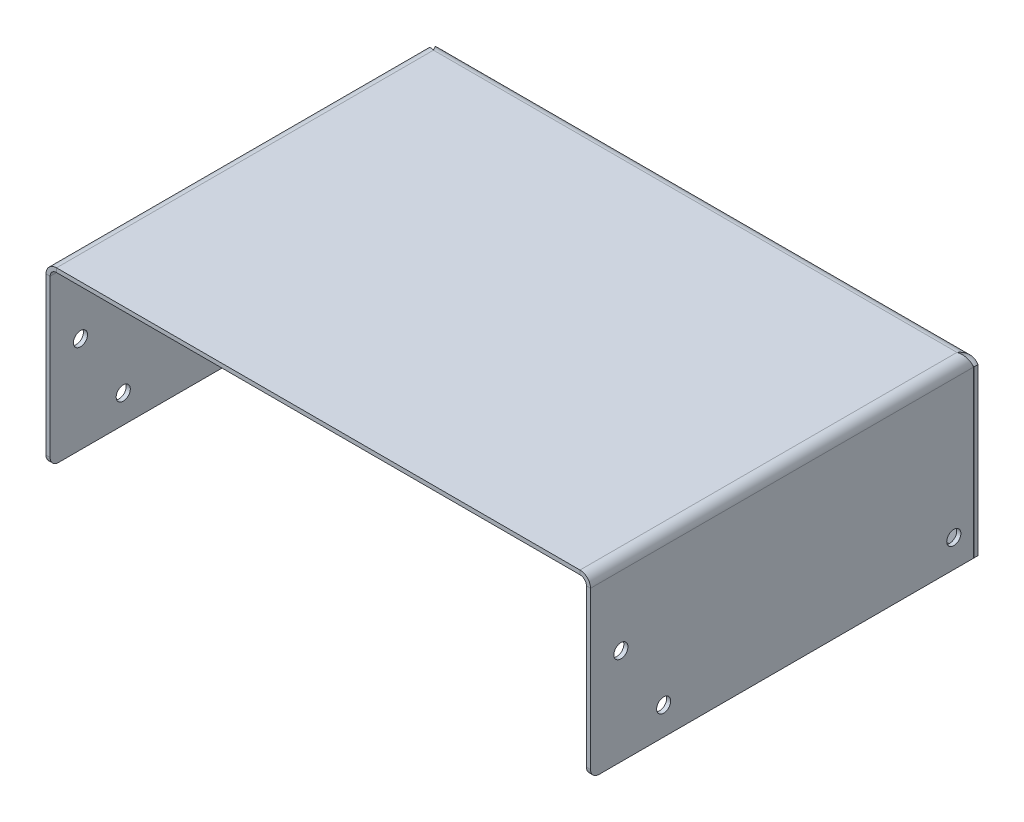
ISO-10303-21;
HEADER;
FILE_DESCRIPTION(('STEP AP214'),'2;1');
FILE_NAME('part.step','',(''),(''),'','','');
FILE_SCHEMA(('AUTOMOTIVE_DESIGN { 1 0 10303 214 1 1 1 1 }'));
ENDSEC;
DATA;
#1=APPLICATION_CONTEXT('core data for automotive mechanical design processes');
#2=APPLICATION_PROTOCOL_DEFINITION('international standard','automotive_design',2000,#1);
#3=PRODUCT_CONTEXT('',#1,'mechanical');
#4=PRODUCT('Part','Part','',(#3));
#5=PRODUCT_RELATED_PRODUCT_CATEGORY('part','',(#4));
#6=PRODUCT_DEFINITION_FORMATION('','',#4);
#7=PRODUCT_DEFINITION_CONTEXT('part definition',#1,'design');
#8=PRODUCT_DEFINITION('design','',#6,#7);
#9=PRODUCT_DEFINITION_SHAPE('','',#8);
#10=(LENGTH_UNIT() NAMED_UNIT(*) SI_UNIT(.MILLI.,.METRE.));
#11=(NAMED_UNIT(*) PLANE_ANGLE_UNIT() SI_UNIT($,.RADIAN.));
#12=(NAMED_UNIT(*) SI_UNIT($,.STERADIAN.) SOLID_ANGLE_UNIT());
#13=UNCERTAINTY_MEASURE_WITH_UNIT(LENGTH_MEASURE(1.E-05),#10,'distance_accuracy_value','');
#14=(GEOMETRIC_REPRESENTATION_CONTEXT(3) GLOBAL_UNCERTAINTY_ASSIGNED_CONTEXT((#13)) GLOBAL_UNIT_ASSIGNED_CONTEXT((#10,
#11,#12)) REPRESENTATION_CONTEXT('',''));
#15=CARTESIAN_POINT('',(0.,0.,0.));
#16=DIRECTION('',(0.,0.,1.));
#17=DIRECTION('',(1.,0.,0.));
#18=AXIS2_PLACEMENT_3D('',#15,#16,#17);
#19=CARTESIAN_POINT('',(288.075794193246,1.2192,0.));
#20=DIRECTION('',(0.,1.,0.));
#21=DIRECTION('',(0.,0.,1.));
#22=AXIS2_PLACEMENT_3D('',#19,#20,#21);
#23=PLANE('',#22);
#24=DIRECTION('',(-1.,0.,0.));
#25=VECTOR('',#24,1.);
#26=CARTESIAN_POINT('',(288.075794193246,1.2192,-111.937799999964));
#27=LINE('',#26,#25);
#28=CARTESIAN_POINT('',(158.5722,1.21920011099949,-111.937799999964));
#29=VERTEX_POINT('',#28);
#30=CARTESIAN_POINT('',(3.12419999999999,1.21920007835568,-111.937799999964));
#31=VERTEX_POINT('',#30);
#32=EDGE_CURVE('E704',#29,#31,#27,.T.);
#33=ORIENTED_EDGE('',*,*,#32,.T.);
#34=DIRECTION('',(0.,0.,1.));
#35=VECTOR('',#34,1.);
#36=CARTESIAN_POINT('',(3.12419999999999,1.2192,-111.937799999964));
#37=LINE('',#36,#35);
#38=CARTESIAN_POINT('',(3.12420000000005,1.21919999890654,0.));
#39=VERTEX_POINT('',#38);
#40=EDGE_CURVE('E413',#31,#39,#37,.T.);
#41=ORIENTED_EDGE('',*,*,#40,.T.);
#42=DIRECTION('',(-1.,0.,0.));
#43=VECTOR('',#42,1.);
#44=CARTESIAN_POINT('',(288.075794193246,1.2192,0.));
#45=LINE('',#44,#43);
#46=CARTESIAN_POINT('',(158.5722,1.21920000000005,0.));
#47=VERTEX_POINT('',#46);
#48=EDGE_CURVE('E681',#47,#39,#45,.T.);
#49=ORIENTED_EDGE('',*,*,#48,.F.);
#50=DIRECTION('',(0.,0.,-1.));
#51=VECTOR('',#50,1.);
#52=CARTESIAN_POINT('',(158.5722,1.21920000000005,0.));
#53=LINE('',#52,#51);
#54=EDGE_CURVE('E687',#47,#29,#53,.T.);
#55=ORIENTED_EDGE('',*,*,#54,.T.);
#56=EDGE_LOOP('',(#33,#41,#49,#55));
#57=FACE_BOUND('',#56,.T.);
#58=ADVANCED_FACE('F115',(#57),#23,.T.);
#59=CARTESIAN_POINT('',(288.075794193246,0.,0.));
#60=DIRECTION('',(0.,1.,0.));
#61=DIRECTION('',(0.,0.,1.));
#62=AXIS2_PLACEMENT_3D('',#59,#60,#61);
#63=PLANE('',#62);
#64=DIRECTION('',(0.,0.,1.));
#65=VECTOR('',#64,1.);
#66=CARTESIAN_POINT('',(3.12419999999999,0.,-111.937799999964));
#67=LINE('',#66,#65);
#68=CARTESIAN_POINT('',(3.12419999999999,0.,-111.937799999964));
#69=VERTEX_POINT('',#68);
#70=CARTESIAN_POINT('',(3.12419999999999,0.,0.));
#71=VERTEX_POINT('',#70);
#72=EDGE_CURVE('E423',#69,#71,#67,.T.);
#73=ORIENTED_EDGE('',*,*,#72,.F.);
#74=DIRECTION('',(-1.,0.,0.));
#75=VECTOR('',#74,1.);
#76=CARTESIAN_POINT('',(288.075794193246,0.,-111.937799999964));
#77=LINE('',#76,#75);
#78=CARTESIAN_POINT('',(158.572200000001,0.,-111.937799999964));
#79=VERTEX_POINT('',#78);
#80=EDGE_CURVE('E420',#79,#69,#77,.T.);
#81=ORIENTED_EDGE('',*,*,#80,.F.);
#82=DIRECTION('',(0.,0.,-1.));
#83=VECTOR('',#82,1.);
#84=CARTESIAN_POINT('',(158.572200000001,0.,0.));
#85=LINE('',#84,#83);
#86=CARTESIAN_POINT('',(158.572200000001,0.,0.));
#87=VERTEX_POINT('',#86);
#88=EDGE_CURVE('E683',#87,#79,#85,.T.);
#89=ORIENTED_EDGE('',*,*,#88,.F.);
#90=DIRECTION('',(-1.,0.,0.));
#91=VECTOR('',#90,1.);
#92=CARTESIAN_POINT('',(288.075794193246,0.,0.));
#93=LINE('',#92,#91);
#94=EDGE_CURVE('E679',#87,#71,#93,.T.);
#95=ORIENTED_EDGE('',*,*,#94,.T.);
#96=EDGE_LOOP('',(#73,#81,#89,#95));
#97=FACE_BOUND('',#96,.T.);
#98=ADVANCED_FACE('F603',(#97),#63,.F.);
#99=CARTESIAN_POINT('',(288.075794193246,0.,0.));
#100=DIRECTION('',(0.,0.,1.));
#101=DIRECTION('',(1.,0.,0.));
#102=AXIS2_PLACEMENT_3D('',#99,#100,#101);
#103=PLANE('',#102);
#104=DIRECTION('',(0.,1.,0.));
#105=VECTOR('',#104,1.);
#106=CARTESIAN_POINT('',(3.12419999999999,0.,0.));
#107=LINE('',#106,#105);
#108=EDGE_CURVE('E426',#71,#39,#107,.T.);
#109=ORIENTED_EDGE('',*,*,#108,.F.);
#110=ORIENTED_EDGE('',*,*,#94,.F.);
#111=DIRECTION('',(-1.01988991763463E-13,1.,0.));
#112=VECTOR('',#111,1.);
#113=CARTESIAN_POINT('',(158.572200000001,0.,0.));
#114=LINE('',#113,#112);
#115=EDGE_CURVE('E699',#87,#47,#114,.T.);
#116=ORIENTED_EDGE('',*,*,#115,.T.);
#117=ORIENTED_EDGE('',*,*,#48,.T.);
#118=EDGE_LOOP('',(#109,#110,#116,#117));
#119=FACE_BOUND('',#118,.T.);
#120=ADVANCED_FACE('F609',(#119),#103,.T.);
#121=CARTESIAN_POINT('',(161.708592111,-1.90499999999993,-113.751359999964));
#122=CARTESIAN_POINT('',(161.708592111,-1.49438203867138,-113.600205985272));
#123=CARTESIAN_POINT('',(161.626960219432,-1.0840560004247,-113.449099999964));
#124=CARTESIAN_POINT('',(161.312736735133,-0.325453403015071,-113.146839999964));
#125=CARTESIAN_POINT('',(161.080268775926,0.0224594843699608,-112.995709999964));
#126=CARTESIAN_POINT('',(160.49965948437,0.603068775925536,-112.693449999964));
#127=CARTESIAN_POINT('',(160.151746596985,0.835536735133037,-112.542319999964));
#128=CARTESIAN_POINT('',(159.393143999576,1.14976021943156,-112.240059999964));
#129=CARTESIAN_POINT('',(158.982817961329,1.23139211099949,-112.088954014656));
#130=CARTESIAN_POINT('',(158.5722,1.23139211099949,-111.937799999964));
#131=CARTESIAN_POINT('',(161.696400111,-1.90499999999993,-113.751359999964));
#132=CARTESIAN_POINT('',(161.696400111,-1.49597828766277,-113.600206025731));
#133=CARTESIAN_POINT('',(161.615085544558,-1.08724723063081,-113.449099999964));
#134=CARTESIAN_POINT('',(161.302083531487,-0.331593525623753,-113.146839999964));
#135=CARTESIAN_POINT('',(161.070519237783,0.0149669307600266,-112.995709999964));
#136=CARTESIAN_POINT('',(160.49216693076,0.593319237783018,-112.693449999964));
#137=CARTESIAN_POINT('',(160.145606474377,0.824883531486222,-112.542319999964));
#138=CARTESIAN_POINT('',(159.38995276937,1.13788554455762,-112.240059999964));
#139=CARTESIAN_POINT('',(158.981221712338,1.21920011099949,-112.088953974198));
#140=CARTESIAN_POINT('',(158.5722,1.21920011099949,-111.937799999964));
#141=CARTESIAN_POINT('',(160.477200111,-1.90499999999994,-113.751359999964));
#142=CARTESIAN_POINT('',(160.477200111,-1.65560318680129,-113.600210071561));
#143=CARTESIAN_POINT('',(160.427618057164,-1.40637025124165,-113.449099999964));
#144=CARTESIAN_POINT('',(160.236763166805,-0.945605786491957,-113.146839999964));
#145=CARTESIAN_POINT('',(160.095565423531,-0.734288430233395,-112.995709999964));
#146=CARTESIAN_POINT('',(159.742911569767,-0.381634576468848,-112.693449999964));
#147=CARTESIAN_POINT('',(159.531594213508,-0.240436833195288,-112.542319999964));
#148=CARTESIAN_POINT('',(159.070829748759,-0.0495819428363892,-112.240059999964));
#149=CARTESIAN_POINT('',(158.821596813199,1.10999486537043E-07,-112.088949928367));
#150=CARTESIAN_POINT('',(158.5722,1.10999486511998E-07,-111.937799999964));
#151=CARTESIAN_POINT('',(160.464886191,-1.90499999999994,-113.751359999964));
#152=CARTESIAN_POINT('',(160.464886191,-1.65721539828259,-113.600210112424));
#153=CARTESIAN_POINT('',(160.415624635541,-1.40959339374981,-113.449099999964));
#154=CARTESIAN_POINT('',(160.226003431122,-0.951807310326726,-113.146839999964));
#155=CARTESIAN_POINT('',(160.085718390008,-0.741855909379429,-112.995709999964));
#156=CARTESIAN_POINT('',(159.735344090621,-0.391481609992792,-112.693449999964));
#157=CARTESIAN_POINT('',(159.525392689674,-0.251196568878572,-112.542319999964));
#158=CARTESIAN_POINT('',(159.067606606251,-0.0615753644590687,-112.240059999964));
#159=CARTESIAN_POINT('',(158.819984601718,-0.0123138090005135,-112.088949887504));
#160=CARTESIAN_POINT('',(158.5722,-0.0123138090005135,-111.937799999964));
#161=B_SPLINE_SURFACE_WITH_KNOTS('',1,3,((#121,#122,#123,#124,#125,#126,#127,#128,#129,#130),
(#131,#132,#133,#134,#135,#136,#137,#138,#139,#140),(#141,#142,#143,#144,#145,#146,#147,#148,
#149,#150),(#151,#152,#153,#154,#155,#156,#157,#158,#159,#160)),.UNSPECIFIED.,.F.,.F.,.F.,(2,1,
1,2),(4,2,2,2,4),(-0.01,0.,1.,1.0101),(0.,0.25,0.5,0.75,1.),.UNSPECIFIED.);
#162=CARTESIAN_POINT('',(161.708592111,-1.90499999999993,-113.751359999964));
#163=CARTESIAN_POINT('',(161.696400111,-1.90499999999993,-113.751359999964));
#164=CARTESIAN_POINT('',(160.477200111,-1.90499999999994,-113.751359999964));
#165=CARTESIAN_POINT('',(160.464886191,-1.90499999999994,-113.751359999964));
#166=B_SPLINE_CURVE_WITH_KNOTS('',1,(#162,#163,#164,#165),.UNSPECIFIED.,.F.,.F.,(2,1,1,2),
(-0.01,0.,1.,1.0101),.UNSPECIFIED.);
#167=CARTESIAN_POINT('',(160.477200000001,-1.90499999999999,-113.751359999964));
#168=VERTEX_POINT('',#167);
#169=CARTESIAN_POINT('',(161.696400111,-1.90499999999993,-113.751359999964));
#170=VERTEX_POINT('',#169);
#171=EDGE_CURVE('E711',#168,#170,#166,.F.);
#172=CARTESIAN_POINT('',(160.477200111,-1.90499999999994,-113.751359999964));
#173=CARTESIAN_POINT('',(160.477210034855,-1.84231587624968,-113.713367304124));
#174=CARTESIAN_POINT('',(160.474106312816,-1.77963446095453,-113.675377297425));
#175=CARTESIAN_POINT('',(160.461746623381,-1.65488408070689,-113.59940129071));
#176=CARTESIAN_POINT('',(160.452491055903,-1.59281507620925,-113.561415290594));
#177=CARTESIAN_POINT('',(160.427909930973,-1.46992437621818,-113.485463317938));
#178=CARTESIAN_POINT('',(160.412587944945,-1.40910196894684,-113.447497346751));
#179=CARTESIAN_POINT('',(160.37604070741,-1.28927794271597,-113.371573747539));
#180=CARTESIAN_POINT('',(160.354815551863,-1.23027629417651,-113.333616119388));
#181=CARTESIAN_POINT('',(160.282501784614,-1.05672551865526,-113.219664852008));
#182=CARTESIAN_POINT('',(160.222782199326,-0.945666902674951,-113.143614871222));
#183=CARTESIAN_POINT('',(160.08276932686,-0.737546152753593,-112.991591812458));
#184=CARTESIAN_POINT('',(160.002486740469,-0.640476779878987,-112.915618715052));
#185=CARTESIAN_POINT('',(159.824450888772,-0.463956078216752,-112.763671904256));
#186=CARTESIAN_POINT('',(159.726697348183,-0.384505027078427,-112.687698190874));
#187=CARTESIAN_POINT('',(159.517385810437,-0.246276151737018,-112.535674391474));
#188=CARTESIAN_POINT('',(159.40582103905,-0.187508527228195,-112.459624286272));
#189=CARTESIAN_POINT('',(159.232911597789,-0.11719051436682,-112.346492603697));
#190=CARTESIAN_POINT('',(159.175029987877,-0.0968562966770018,-112.309352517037));
#191=CARTESIAN_POINT('',(159.057560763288,-0.0618504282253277,-112.235065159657));
#192=CARTESIAN_POINT('',(158.997973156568,-0.0471787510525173,-112.19791788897));
#193=CARTESIAN_POINT('',(158.877642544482,-0.0236468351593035,-112.123611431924));
#194=CARTESIAN_POINT('',(158.816899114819,-0.0147887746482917,-112.086452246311));
#195=CARTESIAN_POINT('',(158.694838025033,-0.00296055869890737,-112.012129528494));
#196=CARTESIAN_POINT('',(158.633520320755,9.14019399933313E-06,-111.974965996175));
#197=CARTESIAN_POINT('',(158.5722,1.10999486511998E-07,-111.937799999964));
#198=B_SPLINE_CURVE_WITH_KNOTS('',3,(#172,#173,#174,#175,#176,#177,#178,#179,#180,#181,#182,
#183,#184,#185,#186,#187,#188,#189,#190,#191,#192,#193,#194,#195,#196,#197),.UNSPECIFIED.,.F.,
.F.,(4,2,2,2,2,2,2,2,2,2,2,2,4),(0.,0.219824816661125,0.439635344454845,0.659316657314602,
0.878994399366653,1.31847763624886,1.75773263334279,2.19699455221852,2.63647278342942,
2.85142154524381,3.06636930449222,3.28139755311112,3.49644247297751),.UNSPECIFIED.);
#199=EDGE_CURVE('E766',#168,#79,#198,.T.);
#200=CARTESIAN_POINT('',(158.5722,-0.0123138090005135,-111.937799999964));
#201=CARTESIAN_POINT('',(158.5722,1.10999486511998E-07,-111.937799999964));
#202=CARTESIAN_POINT('',(158.5722,1.21920011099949,-111.937799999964));
#203=CARTESIAN_POINT('',(158.5722,1.23139211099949,-111.937799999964));
#204=B_SPLINE_CURVE_WITH_KNOTS('',1,(#200,#201,#202,#203),.UNSPECIFIED.,.F.,.F.,(2,1,1,2),
(-0.01,9.9999999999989E-05,1.0001,1.0101),.UNSPECIFIED.);
#205=EDGE_CURVE('E817',#79,#29,#204,.T.);
#206=CARTESIAN_POINT('',(161.696400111,-1.90499999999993,-113.751359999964));
#207=CARTESIAN_POINT('',(161.696411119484,-1.81130688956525,-113.716734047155));
#208=CARTESIAN_POINT('',(161.692185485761,-1.71761807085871,-113.68211011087));
#209=CARTESIAN_POINT('',(161.675345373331,-1.53100180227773,-113.612865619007));
#210=CARTESIAN_POINT('',(161.662731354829,-1.43807431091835,-113.578245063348));
#211=CARTESIAN_POINT('',(161.62921224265,-1.25379641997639,-113.509030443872));
#212=CARTESIAN_POINT('',(161.608313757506,-1.16244482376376,-113.474436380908));
#213=CARTESIAN_POINT('',(161.558416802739,-0.982010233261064,-113.405255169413));
#214=CARTESIAN_POINT('',(161.529418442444,-0.892927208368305,-113.370668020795));
#215=CARTESIAN_POINT('',(161.430521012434,-0.63000086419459,-113.266853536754));
#216=CARTESIAN_POINT('',(161.348719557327,-0.460480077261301,-113.19757308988));
#217=CARTESIAN_POINT('',(161.15616183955,-0.138952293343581,-113.059074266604));
#218=CARTESIAN_POINT('',(161.045413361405,0.013059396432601,-112.989855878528));
#219=CARTESIAN_POINT('',(160.798510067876,0.294826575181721,-112.851407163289));
#220=CARTESIAN_POINT('',(160.662357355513,0.424583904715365,-112.782176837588));
#221=CARTESIAN_POINT('',(160.368960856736,0.657692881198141,-112.643695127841));
#222=CARTESIAN_POINT('',(160.211707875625,0.761032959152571,-112.57444374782));
#223=CARTESIAN_POINT('',(159.881200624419,0.937941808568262,-112.435908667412));
#224=CARTESIAN_POINT('',(159.707938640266,1.01149613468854,-112.366624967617));
#225=CARTESIAN_POINT('',(159.351168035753,1.12631051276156,-112.228118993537));
#226=CARTESIAN_POINT('',(159.167674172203,1.16761584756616,-112.158896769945));
#227=CARTESIAN_POINT('',(158.914183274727,1.20118864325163,-112.064401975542));
#228=CARTESIAN_POINT('',(158.845900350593,1.20794556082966,-112.039058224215));
#229=CARTESIAN_POINT('',(158.70915471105,1.21694560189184,-111.988413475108));
#230=CARTESIAN_POINT('',(158.640692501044,1.21919640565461,-111.963112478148));
#231=CARTESIAN_POINT('',(158.5722,1.21920011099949,-111.937799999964));
#232=B_SPLINE_CURVE_WITH_KNOTS('',3,(#206,#207,#208,#209,#210,#211,#212,#213,#214,#215,#216,
#217,#218,#219,#220,#221,#222,#223,#224,#225,#226,#227,#228,#229,#230,#231),.UNSPECIFIED.,.F.,
.F.,(4,2,2,2,2,2,2,2,2,2,2,2,4),(0.,0.299562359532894,0.599108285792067,0.898415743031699,
1.19771916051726,1.79632536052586,2.3947707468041,2.99316661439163,3.59182409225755,
4.19077155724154,4.78887648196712,5.00821175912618,5.22717287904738),.UNSPECIFIED.);
#233=EDGE_CURVE('E690',#170,#29,#232,.T.);
#234=ORIENTED_EDGE('',*,*,#171,.F.);
#235=ORIENTED_EDGE('',*,*,#199,.T.);
#236=ORIENTED_EDGE('',*,*,#205,.T.);
#237=ORIENTED_EDGE('',*,*,#233,.F.);
#238=EDGE_LOOP('',(#234,#235,#236,#237));
#239=FACE_BOUND('',#238,.T.);
#240=ADVANCED_FACE('F759',(#239),#161,.T.);
#241=CARTESIAN_POINT('',(158.5722,-1.90500011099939,0.));
#242=DIRECTION('',(0.,0.,1.));
#243=DIRECTION('',(1.,0.,0.));
#244=AXIS2_PLACEMENT_3D('',#241,#242,#243);
#245=PLANE('',#244);
#246=CARTESIAN_POINT('',(158.5722,-1.90499999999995,0.));
#247=DIRECTION('',(0.,0.,-1.));
#248=DIRECTION('',(-1.,0.,0.));
#249=AXIS2_PLACEMENT_3D('',#246,#247,#248);
#250=CIRCLE('',#249,1.90500011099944);
#251=CARTESIAN_POINT('',(160.477200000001,-1.90499999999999,0.));
#252=VERTEX_POINT('',#251);
#253=EDGE_CURVE('E800',#87,#252,#250,.T.);
#254=ORIENTED_EDGE('',*,*,#253,.T.);
#255=DIRECTION('',(1.,0.,0.));
#256=VECTOR('',#255,1.);
#257=CARTESIAN_POINT('',(160.4772,-1.90499999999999,0.));
#258=LINE('',#257,#256);
#259=CARTESIAN_POINT('',(161.6964,-1.90499999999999,0.));
#260=VERTEX_POINT('',#259);
#261=EDGE_CURVE('E728',#252,#260,#258,.T.);
#262=ORIENTED_EDGE('',*,*,#261,.T.);
#263=CARTESIAN_POINT('',(158.5722,-1.90500011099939,0.));
#264=DIRECTION('',(0.,0.,-1.));
#265=DIRECTION('',(-1.,0.,0.));
#266=AXIS2_PLACEMENT_3D('',#263,#264,#265);
#267=CIRCLE('',#266,3.12420016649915);
#268=EDGE_CURVE('E685',#47,#260,#267,.T.);
#269=ORIENTED_EDGE('',*,*,#268,.F.);
#270=ORIENTED_EDGE('',*,*,#115,.F.);
#271=EDGE_LOOP('',(#254,#262,#269,#270));
#272=FACE_BOUND('',#271,.T.);
#273=ADVANCED_FACE('F757',(#272),#245,.T.);
#274=CARTESIAN_POINT('',(158.5722,-1.90499999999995,57.8671672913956));
#275=DIRECTION('',(0.,0.,-1.));
#276=DIRECTION('',(-1.,0.,0.));
#277=AXIS2_PLACEMENT_3D('',#274,#275,#276);
#278=CYLINDRICAL_SURFACE('',#277,3.12420011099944);
#279=ORIENTED_EDGE('',*,*,#54,.F.);
#280=ORIENTED_EDGE('',*,*,#268,.T.);
#281=DIRECTION('',(0.,0.,-1.));
#282=VECTOR('',#281,1.);
#283=CARTESIAN_POINT('',(161.696400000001,-1.90499999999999,-111.937799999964));
#284=LINE('',#283,#282);
#285=EDGE_CURVE('E436',#260,#170,#284,.T.);
#286=ORIENTED_EDGE('',*,*,#285,.T.);
#287=ORIENTED_EDGE('',*,*,#233,.T.);
#288=EDGE_LOOP('',(#279,#280,#286,#287));
#289=FACE_BOUND('',#288,.T.);
#290=ADVANCED_FACE('F752',(#289),#278,.T.);
#291=CARTESIAN_POINT('',(158.5722,-1.90499999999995,57.8671672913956));
#292=DIRECTION('',(0.,0.,-1.));
#293=DIRECTION('',(-1.,0.,0.));
#294=AXIS2_PLACEMENT_3D('',#291,#292,#293);
#295=CYLINDRICAL_SURFACE('',#294,1.90500011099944);
#296=ORIENTED_EDGE('',*,*,#88,.T.);
#297=ORIENTED_EDGE('',*,*,#199,.F.);
#298=DIRECTION('',(0.,0.,1.));
#299=VECTOR('',#298,1.);
#300=CARTESIAN_POINT('',(160.477200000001,-1.90499999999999,-111.937799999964));
#301=LINE('',#300,#299);
#302=EDGE_CURVE('E716',#168,#252,#301,.T.);
#303=ORIENTED_EDGE('',*,*,#302,.T.);
#304=ORIENTED_EDGE('',*,*,#253,.F.);
#305=EDGE_LOOP('',(#296,#297,#303,#304));
#306=FACE_BOUND('',#305,.T.);
#307=ADVANCED_FACE('F756',(#306),#295,.F.);
#308=CARTESIAN_POINT('',(161.696400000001,-51.0539999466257,1.63440857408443E-13));
#309=DIRECTION('',(0.,-1.,0.));
#310=DIRECTION('',(1.,0.,0.));
#311=AXIS2_PLACEMENT_3D('',#308,#309,#310);
#312=PLANE('',#311);
#313=DIRECTION('',(0.,0.,-1.));
#314=VECTOR('',#313,1.);
#315=CARTESIAN_POINT('',(161.696400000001,-51.0539999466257,1.63440857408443E-13));
#316=LINE('',#315,#314);
#317=CARTESIAN_POINT('',(161.696400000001,-51.0539999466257,-113.751359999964));
#318=VERTEX_POINT('',#317);
#319=CARTESIAN_POINT('',(161.696400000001,-51.0539999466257,-2.53999999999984));
#320=VERTEX_POINT('',#319);
#321=EDGE_CURVE('E808',#318,#320,#316,.F.);
#322=ORIENTED_EDGE('',*,*,#321,.T.);
#323=DIRECTION('',(-1.,0.,0.));
#324=VECTOR('',#323,1.);
#325=CARTESIAN_POINT('',(161.696400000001,-51.0539999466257,-2.53999999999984));
#326=LINE('',#325,#324);
#327=CARTESIAN_POINT('',(160.477200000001,-51.0539999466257,-2.53999999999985));
#328=VERTEX_POINT('',#327);
#329=EDGE_CURVE('E628',#320,#328,#326,.T.);
#330=ORIENTED_EDGE('',*,*,#329,.T.);
#331=DIRECTION('',(0.,0.,1.));
#332=VECTOR('',#331,1.);
#333=CARTESIAN_POINT('',(160.477200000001,-51.0539999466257,-111.937799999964));
#334=LINE('',#333,#332);
#335=CARTESIAN_POINT('',(160.477200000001,-51.0539999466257,-113.751359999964));
#336=VERTEX_POINT('',#335);
#337=EDGE_CURVE('E722',#336,#328,#334,.T.);
#338=ORIENTED_EDGE('',*,*,#337,.F.);
#339=DIRECTION('',(-1.,0.,0.));
#340=VECTOR('',#339,1.);
#341=CARTESIAN_POINT('',(161.696400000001,-51.0539999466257,-113.751359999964));
#342=LINE('',#341,#340);
#343=EDGE_CURVE('E710',#318,#336,#342,.T.);
#344=ORIENTED_EDGE('',*,*,#343,.F.);
#345=EDGE_LOOP('',(#322,#330,#338,#344));
#346=FACE_BOUND('',#345,.T.);
#347=ADVANCED_FACE('F459',(#346),#312,.T.);
#348=CARTESIAN_POINT('',(161.696400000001,0.,-111.937799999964));
#349=DIRECTION('',(-1.,0.,0.));
#350=DIRECTION('',(0.,-1.,0.));
#351=AXIS2_PLACEMENT_3D('',#348,#349,#350);
#352=PLANE('',#351);
#353=CARTESIAN_POINT('',(161.696400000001,-22.4790002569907,-9.01699997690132));
#354=DIRECTION('',(1.,0.,0.));
#355=DIRECTION('',(0.,1.,0.));
#356=AXIS2_PLACEMENT_3D('',#353,#354,#355);
#357=CIRCLE('',#356,2.0955);
#358=CARTESIAN_POINT('',(161.696400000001,-20.3835002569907,-9.01699997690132));
#359=VERTEX_POINT('',#358);
#360=EDGE_CURVE('E1193',#359,#359,#357,.T.);
#361=ORIENTED_EDGE('',*,*,#360,.F.);
#362=EDGE_LOOP('',(#361));
#363=FACE_BOUND('',#362,.T.);
#364=CARTESIAN_POINT('',(161.696400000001,-42.798999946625,-107.873799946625));
#365=DIRECTION('',(1.,0.,0.));
#366=DIRECTION('',(0.,1.,0.));
#367=AXIS2_PLACEMENT_3D('',#364,#365,#366);
#368=CIRCLE('',#367,2.09549999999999);
#369=CARTESIAN_POINT('',(161.696400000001,-40.703499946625,-107.873799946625));
#370=VERTEX_POINT('',#369);
#371=EDGE_CURVE('E644',#370,#370,#368,.T.);
#372=ORIENTED_EDGE('',*,*,#371,.F.);
#373=EDGE_LOOP('',(#372));
#374=FACE_BOUND('',#373,.T.);
#375=CARTESIAN_POINT('',(161.696400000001,-42.798999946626,-21.716999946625));
#376=DIRECTION('',(1.,0.,0.));
#377=DIRECTION('',(0.,1.,0.));
#378=AXIS2_PLACEMENT_3D('',#375,#376,#377);
#379=CIRCLE('',#378,2.0955);
#380=CARTESIAN_POINT('',(161.696400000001,-40.703499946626,-21.716999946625));
#381=VERTEX_POINT('',#380);
#382=EDGE_CURVE('E640',#381,#381,#379,.T.);
#383=ORIENTED_EDGE('',*,*,#382,.F.);
#384=EDGE_LOOP('',(#383));
#385=FACE_BOUND('',#384,.T.);
#386=DIRECTION('',(0.,-1.,0.));
#387=VECTOR('',#386,1.);
#388=CARTESIAN_POINT('',(161.6964,0.,0.));
#389=LINE('',#388,#387);
#390=CARTESIAN_POINT('',(161.696400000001,-48.5139999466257,1.55155610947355E-13));
#391=VERTEX_POINT('',#390);
#392=EDGE_CURVE('E806',#391,#260,#389,.F.);
#393=ORIENTED_EDGE('',*,*,#392,.F.);
#394=CARTESIAN_POINT('',(161.696400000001,-48.5139999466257,-2.53999999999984));
#395=DIRECTION('',(-1.,0.,0.));
#396=DIRECTION('',(0.,-1.,0.));
#397=AXIS2_PLACEMENT_3D('',#394,#395,#396);
#398=CIRCLE('',#397,2.54);
#399=EDGE_CURVE('E14',#391,#320,#398,.F.);
#400=ORIENTED_EDGE('',*,*,#399,.T.);
#401=ORIENTED_EDGE('',*,*,#321,.F.);
#402=DIRECTION('',(0.,1.,0.));
#403=VECTOR('',#402,1.);
#404=CARTESIAN_POINT('',(161.696400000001,-51.0539999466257,-113.751359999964));
#405=LINE('',#404,#403);
#406=EDGE_CURVE('E707',#170,#318,#405,.F.);
#407=ORIENTED_EDGE('',*,*,#406,.F.);
#408=ORIENTED_EDGE('',*,*,#285,.F.);
#409=EDGE_LOOP('',(#393,#400,#401,#407,#408));
#410=FACE_BOUND('',#409,.T.);
#411=ADVANCED_FACE('F939',(#363,#374,#385,#410),#352,.F.);
#412=CARTESIAN_POINT('',(161.6964,0.,0.));
#413=DIRECTION('',(0.,0.,1.));
#414=DIRECTION('',(0.,-1.,0.));
#415=AXIS2_PLACEMENT_3D('',#412,#413,#414);
#416=PLANE('',#415);
#417=DIRECTION('',(0.,1.,0.));
#418=VECTOR('',#417,1.);
#419=CARTESIAN_POINT('',(160.4772,3.60822483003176E-13,0.));
#420=LINE('',#419,#418);
#421=CARTESIAN_POINT('',(160.477200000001,-48.5139999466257,1.55155610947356E-13));
#422=VERTEX_POINT('',#421);
#423=EDGE_CURVE('E723',#422,#252,#420,.T.);
#424=ORIENTED_EDGE('',*,*,#423,.F.);
#425=DIRECTION('',(-1.,0.,0.));
#426=VECTOR('',#425,1.);
#427=CARTESIAN_POINT('',(161.696400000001,-48.5139999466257,1.55155610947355E-13));
#428=LINE('',#427,#426);
#429=EDGE_CURVE('E124',#422,#391,#428,.F.);
#430=ORIENTED_EDGE('',*,*,#429,.T.);
#431=ORIENTED_EDGE('',*,*,#392,.T.);
#432=ORIENTED_EDGE('',*,*,#261,.F.);
#433=EDGE_LOOP('',(#424,#430,#431,#432));
#434=FACE_BOUND('',#433,.T.);
#435=ADVANCED_FACE('F949',(#434),#416,.T.);
#436=CARTESIAN_POINT('',(160.477200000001,0.,-111.937799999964));
#437=DIRECTION('',(-1.,0.,0.));
#438=DIRECTION('',(0.,-1.,0.));
#439=AXIS2_PLACEMENT_3D('',#436,#437,#438);
#440=PLANE('',#439);
#441=CARTESIAN_POINT('',(160.477200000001,-22.4790002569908,-9.01699997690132));
#442=DIRECTION('',(-1.,0.,0.));
#443=DIRECTION('',(0.,-1.,0.));
#444=AXIS2_PLACEMENT_3D('',#441,#442,#443);
#445=CIRCLE('',#444,2.0955);
#446=CARTESIAN_POINT('',(160.477200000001,-24.5745002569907,-9.01699997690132));
#447=VERTEX_POINT('',#446);
#448=EDGE_CURVE('E650',#447,#447,#445,.T.);
#449=ORIENTED_EDGE('',*,*,#448,.F.);
#450=EDGE_LOOP('',(#449));
#451=FACE_BOUND('',#450,.T.);
#452=CARTESIAN_POINT('',(160.477200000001,-42.798999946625,-107.873799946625));
#453=DIRECTION('',(-1.,0.,0.));
#454=DIRECTION('',(0.,-1.,0.));
#455=AXIS2_PLACEMENT_3D('',#452,#453,#454);
#456=CIRCLE('',#455,2.09549999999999);
#457=CARTESIAN_POINT('',(160.477200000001,-44.894499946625,-107.873799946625));
#458=VERTEX_POINT('',#457);
#459=EDGE_CURVE('E647',#458,#458,#456,.T.);
#460=ORIENTED_EDGE('',*,*,#459,.F.);
#461=EDGE_LOOP('',(#460));
#462=FACE_BOUND('',#461,.T.);
#463=CARTESIAN_POINT('',(160.477200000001,-42.798999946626,-21.716999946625));
#464=DIRECTION('',(-1.,0.,0.));
#465=DIRECTION('',(0.,-1.,0.));
#466=AXIS2_PLACEMENT_3D('',#463,#464,#465);
#467=CIRCLE('',#466,2.0955);
#468=CARTESIAN_POINT('',(160.477200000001,-44.894499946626,-21.716999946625));
#469=VERTEX_POINT('',#468);
#470=EDGE_CURVE('E665',#469,#469,#467,.T.);
#471=ORIENTED_EDGE('',*,*,#470,.F.);
#472=EDGE_LOOP('',(#471));
#473=FACE_BOUND('',#472,.T.);
#474=ORIENTED_EDGE('',*,*,#337,.T.);
#475=CARTESIAN_POINT('',(160.477200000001,-48.5139999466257,-2.53999999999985));
#476=DIRECTION('',(-1.,0.,0.));
#477=DIRECTION('',(0.,-1.,0.));
#478=AXIS2_PLACEMENT_3D('',#475,#476,#477);
#479=CIRCLE('',#478,2.54);
#480=EDGE_CURVE('E139',#328,#422,#479,.T.);
#481=ORIENTED_EDGE('',*,*,#480,.T.);
#482=ORIENTED_EDGE('',*,*,#423,.T.);
#483=ORIENTED_EDGE('',*,*,#302,.F.);
#484=DIRECTION('',(0.,-1.,0.));
#485=VECTOR('',#484,1.);
#486=CARTESIAN_POINT('',(160.477200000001,0.,-113.751359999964));
#487=LINE('',#486,#485);
#488=EDGE_CURVE('E719',#168,#336,#487,.T.);
#489=ORIENTED_EDGE('',*,*,#488,.T.);
#490=EDGE_LOOP('',(#474,#481,#482,#483,#489));
#491=FACE_BOUND('',#490,.T.);
#492=ADVANCED_FACE('F750',(#451,#462,#473,#491),#440,.T.);
#493=CARTESIAN_POINT('',(161.696400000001,-51.0539999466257,-113.751359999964));
#494=DIRECTION('',(0.,0.,-1.));
#495=DIRECTION('',(0.,1.,0.));
#496=AXIS2_PLACEMENT_3D('',#493,#494,#495);
#497=PLANE('',#496);
#498=ORIENTED_EDGE('',*,*,#488,.F.);
#499=ORIENTED_EDGE('',*,*,#171,.T.);
#500=ORIENTED_EDGE('',*,*,#406,.T.);
#501=ORIENTED_EDGE('',*,*,#343,.T.);
#502=EDGE_LOOP('',(#498,#499,#500,#501));
#503=FACE_BOUND('',#502,.T.);
#504=ADVANCED_FACE('F740',(#503),#497,.T.);
#505=CARTESIAN_POINT('',(158.5722,1.21920007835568,-111.937799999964));
#506=CARTESIAN_POINT('',(158.832583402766,1.21920007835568,-112.346809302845));
#507=CARTESIAN_POINT('',(159.0929,1.13788551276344,-112.755552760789));
#508=CARTESIAN_POINT('',(159.613600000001,0.824883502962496,-113.5112064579));
#509=CARTESIAN_POINT('',(159.873950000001,0.59331921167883,-113.857766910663));
#510=CARTESIAN_POINT('',(160.394650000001,0.0149669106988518,-114.436119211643));
#511=CARTESIAN_POINT('',(160.655000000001,-0.331593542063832,-114.667683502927));
#512=CARTESIAN_POINT('',(161.175700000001,-1.08724723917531,-114.980685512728));
#513=CARTESIAN_POINT('',(161.436016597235,-1.49599069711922,-115.06200007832));
#514=CARTESIAN_POINT('',(161.696400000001,-1.905,-115.06200007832));
#515=CARTESIAN_POINT('',(158.5722,7.83556817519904E-08,-111.937799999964));
#516=CARTESIAN_POINT('',(158.832572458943,7.83556806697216E-08,-112.187185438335));
#517=CARTESIAN_POINT('',(159.0929,-0.0495819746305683,-112.436429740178));
#518=CARTESIAN_POINT('',(159.613600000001,-0.240436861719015,-112.897194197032));
#519=CARTESIAN_POINT('',(159.873950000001,-0.381634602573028,-113.10851154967));
#520=CARTESIAN_POINT('',(160.394650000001,-0.734288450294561,-113.461165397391));
#521=CARTESIAN_POINT('',(160.655000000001,-0.94560580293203,-113.602363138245));
#522=CARTESIAN_POINT('',(161.175700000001,-1.40637025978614,-113.793218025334));
#523=CARTESIAN_POINT('',(161.436027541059,-1.65561456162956,-113.84280007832));
#524=CARTESIAN_POINT('',(161.696400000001,-1.905,-113.84280007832));
#525=B_SPLINE_SURFACE_WITH_KNOTS('',1,3,((#505,#506,#507,#508,#509,#510,#511,#512,#513,#514),
(#515,#516,#517,#518,#519,#520,#521,#522,#523,#524)),.UNSPECIFIED.,.F.,.F.,.F.,(2,2),(4,2,2,2,
4),(0.,1.),(0.,0.25,0.5,0.75,1.),.UNSPECIFIED.);
#526=CARTESIAN_POINT('',(158.5722,7.83556817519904E-08,-111.937799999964));
#527=CARTESIAN_POINT('',(158.832572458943,7.83556806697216E-08,-112.187185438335));
#528=CARTESIAN_POINT('',(159.0929,-0.0495819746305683,-112.436429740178));
#529=CARTESIAN_POINT('',(159.613600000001,-0.240436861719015,-112.897194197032));
#530=CARTESIAN_POINT('',(159.873950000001,-0.381634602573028,-113.10851154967));
#531=CARTESIAN_POINT('',(160.394650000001,-0.734288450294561,-113.461165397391));
#532=CARTESIAN_POINT('',(160.655000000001,-0.94560580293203,-113.602363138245));
#533=CARTESIAN_POINT('',(161.175700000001,-1.40637025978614,-113.793218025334));
#534=CARTESIAN_POINT('',(161.436027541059,-1.65561456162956,-113.84280007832));
#535=CARTESIAN_POINT('',(161.696400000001,-1.905,-113.84280007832));
#536=B_SPLINE_CURVE_WITH_KNOTS('',3,(#526,#527,#528,#529,#530,#531,#532,#533,#534,#535),
.UNSPECIFIED.,.F.,.F.,(4,2,2,2,4),(0.,0.25,0.5,0.75,1.),.UNSPECIFIED.);
#537=CARTESIAN_POINT('',(161.696400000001,-1.90499999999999,-113.842799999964));
#538=VERTEX_POINT('',#537);
#539=EDGE_CURVE('E500',#79,#538,#536,.T.);
#540=CARTESIAN_POINT('',(161.696400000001,-1.905,-113.84280007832));
#541=CARTESIAN_POINT('',(161.696400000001,-1.905,-115.06200007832));
#542=B_SPLINE_CURVE_WITH_KNOTS('',1,(#540,#541),.UNSPECIFIED.,.F.,.F.,(2,2),(0.,1.),.UNSPECIFIED.);
#543=CARTESIAN_POINT('',(161.696400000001,-1.90499999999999,-115.061999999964));
#544=VERTEX_POINT('',#543);
#545=EDGE_CURVE('E377',#538,#544,#542,.T.);
#546=CARTESIAN_POINT('',(161.696400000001,-1.905,-115.06200007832));
#547=CARTESIAN_POINT('',(161.436016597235,-1.49599069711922,-115.06200007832));
#548=CARTESIAN_POINT('',(161.175700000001,-1.08724723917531,-114.980685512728));
#549=CARTESIAN_POINT('',(160.655000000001,-0.331593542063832,-114.667683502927));
#550=CARTESIAN_POINT('',(160.394650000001,0.0149669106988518,-114.436119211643));
#551=CARTESIAN_POINT('',(159.873950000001,0.59331921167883,-113.857766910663));
#552=CARTESIAN_POINT('',(159.613600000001,0.824883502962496,-113.5112064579));
#553=CARTESIAN_POINT('',(159.0929,1.13788551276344,-112.755552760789));
#554=CARTESIAN_POINT('',(158.832583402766,1.21920007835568,-112.346809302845));
#555=CARTESIAN_POINT('',(158.5722,1.21920007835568,-111.937799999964));
#556=B_SPLINE_CURVE_WITH_KNOTS('',3,(#546,#547,#548,#549,#550,#551,#552,#553,#554,#555),
.UNSPECIFIED.,.F.,.F.,(4,2,2,2,4),(0.,0.25,0.5,0.75,1.),.UNSPECIFIED.);
#557=EDGE_CURVE('E437',#29,#544,#556,.F.);
#558=ORIENTED_EDGE('',*,*,#205,.F.);
#559=ORIENTED_EDGE('',*,*,#539,.T.);
#560=ORIENTED_EDGE('',*,*,#545,.T.);
#561=ORIENTED_EDGE('',*,*,#557,.F.);
#562=EDGE_LOOP('',(#558,#559,#560,#561));
#563=FACE_BOUND('',#562,.T.);
#564=ADVANCED_FACE('F453',(#563),#525,.T.);
#565=CARTESIAN_POINT('',(0.,-1.905,-115.07419207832));
#566=CARTESIAN_POINT('',(0.26038351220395,-1.4943944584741,-115.07419207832));
#567=CARTESIAN_POINT('',(0.520700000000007,-1.08405600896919,-114.992560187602));
#568=CARTESIAN_POINT('',(1.0414,-0.325453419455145,-114.678336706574));
#569=CARTESIAN_POINT('',(1.30174999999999,0.0224594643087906,-114.445868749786));
#570=CARTESIAN_POINT('',(1.82244999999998,0.603068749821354,-113.865259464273));
#571=CARTESIAN_POINT('',(2.08279999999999,0.835536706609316,-113.517346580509));
#572=CARTESIAN_POINT('',(2.60349999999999,1.14976018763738,-112.758743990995));
#573=CARTESIAN_POINT('',(2.86381648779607,1.23139207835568,-112.34840554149));
#574=CARTESIAN_POINT('',(3.12419999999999,1.23139207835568,-111.937799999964));
#575=CARTESIAN_POINT('',(0.,-1.905,-115.06200007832));
#576=CARTESIAN_POINT('',(0.260383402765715,-1.49599069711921,-115.06200007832));
#577=CARTESIAN_POINT('',(0.520700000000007,-1.0872472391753,-114.980685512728));
#578=CARTESIAN_POINT('',(1.0414,-0.331593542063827,-114.667683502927));
#579=CARTESIAN_POINT('',(1.30174999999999,0.0149669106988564,-114.436119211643));
#580=CARTESIAN_POINT('',(1.82244999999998,0.593319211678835,-113.857766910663));
#581=CARTESIAN_POINT('',(2.08279999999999,0.824883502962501,-113.5112064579));
#582=CARTESIAN_POINT('',(2.60349999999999,1.13788551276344,-112.755552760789));
#583=CARTESIAN_POINT('',(2.8638165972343,1.21920007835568,-112.346809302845));
#584=CARTESIAN_POINT('',(3.12419999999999,1.21920007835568,-111.937799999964));
#585=CARTESIAN_POINT('',(0.,-1.905,-113.84280007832));
#586=CARTESIAN_POINT('',(0.260372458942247,-1.65561456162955,-113.84280007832));
#587=CARTESIAN_POINT('',(0.520700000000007,-1.40637025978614,-113.793218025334));
#588=CARTESIAN_POINT('',(1.0414,-0.945605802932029,-113.602363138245));
#589=CARTESIAN_POINT('',(1.30174999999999,-0.73428845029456,-113.461165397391));
#590=CARTESIAN_POINT('',(1.82244999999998,-0.381634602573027,-113.10851154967));
#591=CARTESIAN_POINT('',(2.08279999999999,-0.24043686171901,-112.897194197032));
#592=CARTESIAN_POINT('',(2.60349999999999,-0.0495819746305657,-112.436429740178));
#593=CARTESIAN_POINT('',(2.86382754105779,7.83556817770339E-08,-112.187185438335));
#594=CARTESIAN_POINT('',(3.12419999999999,7.83556817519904E-08,-111.937799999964));
#595=CARTESIAN_POINT('',(0.,-1.905,-113.83048615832));
#596=CARTESIAN_POINT('',(0.26037234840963,-1.65722676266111,-113.83048615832));
#597=CARTESIAN_POINT('',(0.520700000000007,-1.40959340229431,-113.781224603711));
#598=CARTESIAN_POINT('',(1.0414,-0.951807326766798,-113.591603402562));
#599=CARTESIAN_POINT('',(1.30174999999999,-0.741855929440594,-113.451318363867));
#600=CARTESIAN_POINT('',(1.82244999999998,-0.391481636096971,-113.100944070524));
#601=CARTESIAN_POINT('',(2.08279999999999,-0.251196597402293,-112.890992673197));
#602=CARTESIAN_POINT('',(2.60349999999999,-0.0615753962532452,-112.43320659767));
#603=CARTESIAN_POINT('',(2.86382765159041,-0.0123138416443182,-112.185573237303));
#604=CARTESIAN_POINT('',(3.12419999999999,-0.0123138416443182,-111.937799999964));
#605=B_SPLINE_SURFACE_WITH_KNOTS('',1,3,((#565,#566,#567,#568,#569,#570,#571,#572,#573,#574),
(#575,#576,#577,#578,#579,#580,#581,#582,#583,#584),(#585,#586,#587,#588,#589,#590,#591,#592,
#593,#594),(#595,#596,#597,#598,#599,#600,#601,#602,#603,#604)),.UNSPECIFIED.,.F.,.F.,.F.,(2,1,
1,2),(4,2,2,2,4),(-0.01,0.,1.,1.0101),(0.,0.25,0.5,0.75,1.),.UNSPECIFIED.);
#606=CARTESIAN_POINT('',(0.,-1.905,-113.84280007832));
#607=CARTESIAN_POINT('',(0.0760510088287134,-1.83216293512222,-113.842820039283));
#608=CARTESIAN_POINT('',(0.152098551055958,-1.7593263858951,-113.838623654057));
#609=CARTESIAN_POINT('',(0.30418189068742,-1.61461526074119,-113.821940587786));
#610=CARTESIAN_POINT('',(0.380217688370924,-1.54274056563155,-113.809454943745));
#611=CARTESIAN_POINT('',(0.532211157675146,-1.40097056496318,-113.776353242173));
#612=CARTESIAN_POINT('',(0.608168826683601,-1.33107324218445,-113.755745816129));
#613=CARTESIAN_POINT('',(0.76008692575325,-1.19409260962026,-113.706677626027));
#614=CARTESIAN_POINT('',(0.836047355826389,-1.12700938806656,-113.678216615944));
#615=CARTESIAN_POINT('',(0.993088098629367,-0.992135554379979,-113.611637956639));
#616=CARTESIAN_POINT('',(1.0741685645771,-0.924601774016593,-113.572998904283));
#617=CARTESIAN_POINT('',(1.23633095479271,-0.794750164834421,-113.487768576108));
#618=CARTESIAN_POINT('',(1.3174128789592,-0.732432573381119,-113.441176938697));
#619=CARTESIAN_POINT('',(1.47959016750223,-0.613942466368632,-113.34073571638));
#620=CARTESIAN_POINT('',(1.56068553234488,-0.557770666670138,-113.2868852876));
#621=CARTESIAN_POINT('',(1.72287059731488,-0.452418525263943,-113.172734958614));
#622=CARTESIAN_POINT('',(1.80396029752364,-0.403237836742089,-113.112435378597));
#623=CARTESIAN_POINT('',(1.9662259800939,-0.312549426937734,-112.98621404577));
#624=CARTESIAN_POINT('',(2.04740195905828,-0.271050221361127,-112.920286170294));
#625=CARTESIAN_POINT('',(2.20975662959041,-0.196418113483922,-112.783860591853));
#626=CARTESIAN_POINT('',(2.29093532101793,-0.163284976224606,-112.713363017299));
#627=CARTESIAN_POINT('',(2.45320006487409,-0.105908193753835,-112.568931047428));
#628=CARTESIAN_POINT('',(2.53428612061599,-0.0816547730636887,-112.495000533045));
#629=CARTESIAN_POINT('',(2.69642106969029,-0.0423583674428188,-112.344758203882));
#630=CARTESIAN_POINT('',(2.77746996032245,-0.0273105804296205,-112.268447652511));
#631=CARTESIAN_POINT('',(2.9028240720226,-0.0113174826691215,-112.14945095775));
#632=CARTESIAN_POINT('',(2.94714022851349,-0.00707166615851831,-112.10719449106));
#633=CARTESIAN_POINT('',(3.03570254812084,-0.00141461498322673,-112.022560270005));
#634=CARTESIAN_POINT('',(3.0799487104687,1.11682266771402E-06,-111.980182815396));
#635=CARTESIAN_POINT('',(3.12419999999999,7.83556817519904E-08,-111.937799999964));
#636=B_SPLINE_CURVE_WITH_KNOTS('',3,(#606,#607,#608,#609,#610,#611,#612,#613,#614,#615,#616,
#617,#618,#619,#620,#621,#622,#623,#624,#625,#626,#627,#628,#629,#630,#631,#632,#633,#634,#635),
.UNSPECIFIED.,.F.,.F.,(4,2,2,2,2,2,2,2,2,2,2,2,2,2,4),(0.,0.315825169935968,0.631610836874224,
0.947061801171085,1.26252264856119,1.59923673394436,1.93596613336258,2.27273471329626,
2.60948658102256,2.94660956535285,3.28372308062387,3.62046435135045,3.95702981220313,
4.14111291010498,4.32490325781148),.UNSPECIFIED.);
#637=CARTESIAN_POINT('',(0.,-1.90499999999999,-113.842799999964));
#638=VERTEX_POINT('',#637);
#639=EDGE_CURVE('E444',#638,#69,#636,.T.);
#640=CARTESIAN_POINT('',(3.12419999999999,-0.0123138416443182,-111.937799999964));
#641=CARTESIAN_POINT('',(3.12419999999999,7.83556817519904E-08,-111.937799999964));
#642=CARTESIAN_POINT('',(3.12419999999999,1.21920007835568,-111.937799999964));
#643=CARTESIAN_POINT('',(3.12419999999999,1.23139207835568,-111.937799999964));
#644=B_SPLINE_CURVE_WITH_KNOTS('',1,(#640,#641,#642,#643),.UNSPECIFIED.,.F.,.F.,(2,1,1,2),
(-0.01,9.9999999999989E-05,1.0001,1.0101),.UNSPECIFIED.);
#645=EDGE_CURVE('E363',#69,#31,#644,.T.);
#646=CARTESIAN_POINT('',(0.,-1.905,-115.06200007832));
#647=CARTESIAN_POINT('',(0.0557589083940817,-1.81741754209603,-115.062009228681));
#648=CARTESIAN_POINT('',(0.111516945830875,-1.72983642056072,-115.058317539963));
#649=CARTESIAN_POINT('',(0.223022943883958,-1.55530454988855,-115.043599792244));
#650=CARTESIAN_POINT('',(0.278770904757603,-1.46835370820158,-115.032574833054));
#651=CARTESIAN_POINT('',(0.390305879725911,-1.29562036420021,-115.003247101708));
#652=CARTESIAN_POINT('',(0.446092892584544,-1.20983876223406,-114.98493901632));
#653=CARTESIAN_POINT('',(0.557674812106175,-1.04011292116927,-114.941177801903));
#654=CARTESIAN_POINT('',(0.613469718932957,-0.956168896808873,-114.915723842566));
#655=CARTESIAN_POINT('',(0.735607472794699,-0.77508007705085,-114.852377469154));
#656=CARTESIAN_POINT('',(0.801951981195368,-0.678436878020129,-114.813043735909));
#657=CARTESIAN_POINT('',(0.934666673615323,-0.489526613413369,-114.72490097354));
#658=CARTESIAN_POINT('',(1.00103685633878,-0.397261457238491,-114.676087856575));
#659=CARTESIAN_POINT('',(1.13372566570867,-0.218131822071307,-114.569520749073));
#660=CARTESIAN_POINT('',(1.20004429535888,-0.131263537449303,-114.511773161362));
#661=CARTESIAN_POINT('',(1.33271616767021,0.0363068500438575,-114.387864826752));
#662=CARTESIAN_POINT('',(1.39906941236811,0.11700613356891,-114.321700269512));
#663=CARTESIAN_POINT('',(1.53179238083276,0.271408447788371,-114.181622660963));
#664=CARTESIAN_POINT('',(1.59816210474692,0.345109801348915,-114.107707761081));
#665=CARTESIAN_POINT('',(1.73087080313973,0.48472536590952,-113.952917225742));
#666=CARTESIAN_POINT('',(1.79720977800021,0.550643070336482,-113.872044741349));
#667=CARTESIAN_POINT('',(1.92994903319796,0.674132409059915,-113.704033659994));
#668=CARTESIAN_POINT('',(1.99634930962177,0.731695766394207,-113.616888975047));
#669=CARTESIAN_POINT('',(2.12913039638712,0.837799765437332,-113.43731643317));
#670=CARTESIAN_POINT('',(2.19551120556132,0.886343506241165,-113.344890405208));
#671=CARTESIAN_POINT('',(2.33369140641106,0.977522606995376,-113.147925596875));
#672=CARTESIAN_POINT('',(2.40549131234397,1.01935352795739,-113.043013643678));
#673=CARTESIAN_POINT('',(2.54909432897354,1.09143591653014,-112.829272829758));
#674=CARTESIAN_POINT('',(2.62089743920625,1.12168615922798,-112.720443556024));
#675=CARTESIAN_POINT('',(2.76461435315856,1.17027734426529,-112.499978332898));
#676=CARTESIAN_POINT('',(2.83652815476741,1.18859962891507,-112.388338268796));
#677=CARTESIAN_POINT('',(2.98036005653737,1.21307417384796,-112.163732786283));
#678=CARTESIAN_POINT('',(3.05227815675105,1.21922622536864,-112.05076734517));
#679=CARTESIAN_POINT('',(3.12419999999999,1.21920007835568,-111.937799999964));
#680=B_SPLINE_CURVE_WITH_KNOTS('',3,(#646,#647,#648,#649,#650,#651,#652,#653,#654,#655,#656,
#657,#658,#659,#660,#661,#662,#663,#664,#665,#666,#667,#668,#669,#670,#671,#672,#673,#674,#675,
#676,#677,#678,#679),.UNSPECIFIED.,.F.,.F.,(4,2,2,2,2,2,2,2,2,2,2,2,2,2,2,2,4),(0.,
0.311408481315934,0.622770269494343,0.934359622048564,1.24598519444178,1.61647397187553,
1.98712287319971,2.3575073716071,2.72806014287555,3.09870149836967,3.46917586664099,
3.8400148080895,4.210726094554,4.61166285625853,5.01264201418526,5.41424688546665,
5.81585864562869),.UNSPECIFIED.);
#681=CARTESIAN_POINT('',(0.,-1.905,-115.06200007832));
#682=VERTEX_POINT('',#681);
#683=EDGE_CURVE('E432',#682,#31,#680,.T.);
#684=CARTESIAN_POINT('',(0.,-1.905,-115.07419207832));
#685=CARTESIAN_POINT('',(0.,-1.905,-115.06200007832));
#686=CARTESIAN_POINT('',(0.,-1.905,-113.84280007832));
#687=CARTESIAN_POINT('',(0.,-1.905,-113.83048615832));
#688=B_SPLINE_CURVE_WITH_KNOTS('',1,(#684,#685,#686,#687),.UNSPECIFIED.,.F.,.F.,(2,1,1,2),
(-0.01,0.,1.,1.0101),.UNSPECIFIED.);
#689=EDGE_CURVE('E486',#638,#682,#688,.F.);
#690=ORIENTED_EDGE('',*,*,#639,.T.);
#691=ORIENTED_EDGE('',*,*,#645,.T.);
#692=ORIENTED_EDGE('',*,*,#683,.F.);
#693=ORIENTED_EDGE('',*,*,#689,.F.);
#694=EDGE_LOOP('',(#690,#691,#692,#693));
#695=FACE_BOUND('',#694,.T.);
#696=ADVANCED_FACE('F446',(#695),#605,.T.);
#697=CARTESIAN_POINT('',(242.604201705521,-1.905,-111.937799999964));
#698=DIRECTION('',(-1.,0.,0.));
#699=DIRECTION('',(0.,0.,1.));
#700=AXIS2_PLACEMENT_3D('',#697,#698,#699);
#701=CYLINDRICAL_SURFACE('',#700,3.12420007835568);
#702=DIRECTION('',(-1.,0.,0.));
#703=VECTOR('',#702,1.);
#704=CARTESIAN_POINT('',(288.075794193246,-1.90499999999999,-115.061999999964));
#705=LINE('',#704,#703);
#706=EDGE_CURVE('E537',#544,#682,#705,.T.);
#707=ORIENTED_EDGE('',*,*,#706,.T.);
#708=ORIENTED_EDGE('',*,*,#683,.T.);
#709=ORIENTED_EDGE('',*,*,#32,.F.);
#710=ORIENTED_EDGE('',*,*,#557,.T.);
#711=EDGE_LOOP('',(#707,#708,#709,#710));
#712=FACE_BOUND('',#711,.T.);
#713=ADVANCED_FACE('F404',(#712),#701,.T.);
#714=CARTESIAN_POINT('',(242.604201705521,-1.905,-111.937799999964));
#715=DIRECTION('',(-1.,0.,0.));
#716=DIRECTION('',(0.,0.,1.));
#717=AXIS2_PLACEMENT_3D('',#714,#715,#716);
#718=CYLINDRICAL_SURFACE('',#717,1.90500007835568);
#719=DIRECTION('',(-1.,0.,0.));
#720=VECTOR('',#719,1.);
#721=CARTESIAN_POINT('',(288.075794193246,-1.90499999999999,-113.842799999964));
#722=LINE('',#721,#720);
#723=EDGE_CURVE('E496',#538,#638,#722,.T.);
#724=ORIENTED_EDGE('',*,*,#723,.F.);
#725=ORIENTED_EDGE('',*,*,#539,.F.);
#726=ORIENTED_EDGE('',*,*,#80,.T.);
#727=ORIENTED_EDGE('',*,*,#639,.F.);
#728=EDGE_LOOP('',(#724,#725,#726,#727));
#729=FACE_BOUND('',#728,.T.);
#730=ADVANCED_FACE('F455',(#729),#718,.F.);
#731=CARTESIAN_POINT('',(288.075794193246,-51.0539999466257,-115.061999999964));
#732=DIRECTION('',(0.,-1.,0.));
#733=DIRECTION('',(0.,0.,-1.));
#734=AXIS2_PLACEMENT_3D('',#731,#732,#733);
#735=PLANE('',#734);
#736=DIRECTION('',(-1.,0.,0.));
#737=VECTOR('',#736,1.);
#738=CARTESIAN_POINT('',(288.075794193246,-51.0539999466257,-115.061999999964));
#739=LINE('',#738,#737);
#740=CARTESIAN_POINT('',(161.6964,-51.0539999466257,-115.061999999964));
#741=VERTEX_POINT('',#740);
#742=CARTESIAN_POINT('',(0.,-51.0539999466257,-115.061999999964));
#743=VERTEX_POINT('',#742);
#744=EDGE_CURVE('E519',#741,#743,#739,.T.);
#745=ORIENTED_EDGE('',*,*,#744,.F.);
#746=DIRECTION('',(0.,0.,-1.));
#747=VECTOR('',#746,1.);
#748=CARTESIAN_POINT('',(161.6964,-51.0539999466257,-115.061999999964));
#749=LINE('',#748,#747);
#750=CARTESIAN_POINT('',(161.6964,-51.0539999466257,-113.842799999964));
#751=VERTEX_POINT('',#750);
#752=EDGE_CURVE('E534',#741,#751,#749,.F.);
#753=ORIENTED_EDGE('',*,*,#752,.T.);
#754=DIRECTION('',(-1.,0.,0.));
#755=VECTOR('',#754,1.);
#756=CARTESIAN_POINT('',(288.075794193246,-51.0539999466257,-113.842799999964));
#757=LINE('',#756,#755);
#758=CARTESIAN_POINT('',(0.,-51.0539999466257,-113.842799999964));
#759=VERTEX_POINT('',#758);
#760=EDGE_CURVE('E530',#751,#759,#757,.T.);
#761=ORIENTED_EDGE('',*,*,#760,.T.);
#762=DIRECTION('',(0.,0.,1.));
#763=VECTOR('',#762,1.);
#764=CARTESIAN_POINT('',(0.,-51.0539999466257,-115.061999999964));
#765=LINE('',#764,#763);
#766=EDGE_CURVE('E383',#743,#759,#765,.T.);
#767=ORIENTED_EDGE('',*,*,#766,.F.);
#768=EDGE_LOOP('',(#745,#753,#761,#767));
#769=FACE_BOUND('',#768,.T.);
#770=ADVANCED_FACE('F339',(#769),#735,.T.);
#771=CARTESIAN_POINT('',(288.075794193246,0.,-115.061999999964));
#772=DIRECTION('',(0.,0.,-1.));
#773=DIRECTION('',(-1.,0.,0.));
#774=AXIS2_PLACEMENT_3D('',#771,#772,#773);
#775=PLANE('',#774);
#776=ORIENTED_EDGE('',*,*,#706,.F.);
#777=DIRECTION('',(0.,-1.,0.));
#778=VECTOR('',#777,1.);
#779=CARTESIAN_POINT('',(161.696400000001,1.70696790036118E-12,-115.061999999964));
#780=LINE('',#779,#778);
#781=EDGE_CURVE('E527',#544,#741,#780,.T.);
#782=ORIENTED_EDGE('',*,*,#781,.T.);
#783=ORIENTED_EDGE('',*,*,#744,.T.);
#784=DIRECTION('',(0.,1.,0.));
#785=VECTOR('',#784,1.);
#786=CARTESIAN_POINT('',(0.,0.,-115.061999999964));
#787=LINE('',#786,#785);
#788=EDGE_CURVE('E491',#682,#743,#787,.F.);
#789=ORIENTED_EDGE('',*,*,#788,.F.);
#790=EDGE_LOOP('',(#776,#782,#783,#789));
#791=FACE_BOUND('',#790,.T.);
#792=ADVANCED_FACE('F395',(#791),#775,.T.);
#793=CARTESIAN_POINT('',(161.696400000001,1.70696790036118E-12,-115.061999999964));
#794=DIRECTION('',(1.,0.,0.));
#795=DIRECTION('',(0.,-1.,0.));
#796=AXIS2_PLACEMENT_3D('',#793,#794,#795);
#797=PLANE('',#796);
#798=ORIENTED_EDGE('',*,*,#752,.F.);
#799=ORIENTED_EDGE('',*,*,#781,.F.);
#800=ORIENTED_EDGE('',*,*,#545,.F.);
#801=DIRECTION('',(0.,1.,0.));
#802=VECTOR('',#801,1.);
#803=CARTESIAN_POINT('',(161.696400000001,0.,-113.842799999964));
#804=LINE('',#803,#802);
#805=EDGE_CURVE('E518',#538,#751,#804,.F.);
#806=ORIENTED_EDGE('',*,*,#805,.T.);
#807=EDGE_LOOP('',(#798,#799,#800,#806));
#808=FACE_BOUND('',#807,.T.);
#809=ADVANCED_FACE('F385',(#808),#797,.T.);
#810=CARTESIAN_POINT('',(288.075794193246,0.,-113.842799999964));
#811=DIRECTION('',(0.,0.,-1.));
#812=DIRECTION('',(-1.,0.,0.));
#813=AXIS2_PLACEMENT_3D('',#810,#811,#812);
#814=PLANE('',#813);
#815=ORIENTED_EDGE('',*,*,#805,.F.);
#816=ORIENTED_EDGE('',*,*,#723,.T.);
#817=DIRECTION('',(0.,-1.,0.));
#818=VECTOR('',#817,1.);
#819=CARTESIAN_POINT('',(0.,0.,-113.842799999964));
#820=LINE('',#819,#818);
#821=EDGE_CURVE('E492',#638,#759,#820,.T.);
#822=ORIENTED_EDGE('',*,*,#821,.T.);
#823=ORIENTED_EDGE('',*,*,#760,.F.);
#824=EDGE_LOOP('',(#815,#816,#822,#823));
#825=FACE_BOUND('',#824,.T.);
#826=ADVANCED_FACE('F394',(#825),#814,.F.);
#827=CARTESIAN_POINT('',(0.,1.2192,-111.937799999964));
#828=DIRECTION('',(-1.,0.,0.));
#829=DIRECTION('',(0.,0.,1.));
#830=AXIS2_PLACEMENT_3D('',#827,#828,#829);
#831=PLANE('',#830);
#832=ORIENTED_EDGE('',*,*,#821,.F.);
#833=ORIENTED_EDGE('',*,*,#689,.T.);
#834=ORIENTED_EDGE('',*,*,#788,.T.);
#835=ORIENTED_EDGE('',*,*,#766,.T.);
#836=EDGE_LOOP('',(#832,#833,#834,#835));
#837=FACE_BOUND('',#836,.T.);
#838=ADVANCED_FACE('F398',(#837),#831,.T.);
#839=CARTESIAN_POINT('',(3.12419999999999,-1.90499999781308,0.));
#840=DIRECTION('',(0.,0.,1.));
#841=DIRECTION('',(1.,0.,0.));
#842=AXIS2_PLACEMENT_3D('',#839,#840,#841);
#843=PLANE('',#842);
#844=DIRECTION('',(-1.,0.,0.));
#845=VECTOR('',#844,1.);
#846=CARTESIAN_POINT('',(0.,-1.90500000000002,0.));
#847=LINE('',#846,#845);
#848=CARTESIAN_POINT('',(1.21920000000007,-1.90500000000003,0.));
#849=VERTEX_POINT('',#848);
#850=CARTESIAN_POINT('',(2.18691167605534E-09,-1.90499999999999,0.));
#851=VERTEX_POINT('',#850);
#852=EDGE_CURVE('E261',#849,#851,#847,.T.);
#853=ORIENTED_EDGE('',*,*,#852,.F.);
#854=CARTESIAN_POINT('',(3.12419999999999,-1.905,0.));
#855=DIRECTION('',(0.,0.,1.));
#856=DIRECTION('',(1.,0.,0.));
#857=AXIS2_PLACEMENT_3D('',#854,#855,#856);
#858=CIRCLE('',#857,1.90499999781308);
#859=EDGE_CURVE('E279',#849,#71,#858,.F.);
#860=ORIENTED_EDGE('',*,*,#859,.T.);
#861=ORIENTED_EDGE('',*,*,#108,.T.);
#862=CARTESIAN_POINT('',(3.12419999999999,-1.90499999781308,0.));
#863=DIRECTION('',(0.,0.,-1.));
#864=DIRECTION('',(-1.,0.,0.));
#865=AXIS2_PLACEMENT_3D('',#862,#863,#864);
#866=CIRCLE('',#865,3.12419999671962);
#867=EDGE_CURVE('E274',#851,#39,#866,.T.);
#868=ORIENTED_EDGE('',*,*,#867,.F.);
#869=EDGE_LOOP('',(#853,#860,#861,#868));
#870=FACE_BOUND('',#869,.T.);
#871=ADVANCED_FACE('F302',(#870),#843,.T.);
#872=CARTESIAN_POINT('',(3.12419999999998,1.21919999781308,-111.937799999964));
#873=CARTESIAN_POINT('',(2.71517830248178,1.21919999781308,-112.088953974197));
#874=CARTESIAN_POINT('',(2.30644726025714,1.13788543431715,-112.240059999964));
#875=CARTESIAN_POINT('',(1.55079358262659,0.824883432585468,-112.542319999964));
#876=CARTESIAN_POINT('',(1.20423313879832,0.593319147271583,-112.693449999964));
#877=CARTESIAN_POINT('',(0.625880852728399,0.0149668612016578,-112.995709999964));
#878=CARTESIAN_POINT('',(0.394316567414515,-0.331593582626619,-113.146839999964));
#879=CARTESIAN_POINT('',(0.0813145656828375,-1.08724726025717,-113.449099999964));
#880=CARTESIAN_POINT('',(2.18691027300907E-09,-1.4959783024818,-113.600206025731));
#881=CARTESIAN_POINT('',(2.18691167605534E-09,-1.90500000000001,-113.751359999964));
#882=CARTESIAN_POINT('',(3.12419999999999,-2.18691796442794E-09,-111.937799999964));
#883=CARTESIAN_POINT('',(2.87480320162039,-2.18691867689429E-09,-112.088949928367));
#884=CARTESIAN_POINT('',(2.62557028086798,-0.0495820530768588,-112.240059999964));
#885=CARTESIAN_POINT('',(2.1648058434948,-0.240436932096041,-112.542319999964));
#886=CARTESIAN_POINT('',(1.95348849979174,-0.381634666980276,-112.693449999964));
#887=CARTESIAN_POINT('',(1.60083466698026,-0.734288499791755,-112.995709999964));
#888=CARTESIAN_POINT('',(1.45963693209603,-0.945605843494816,-113.146839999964));
#889=CARTESIAN_POINT('',(1.26878205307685,-1.406370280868,-113.449099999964));
#890=CARTESIAN_POINT('',(1.21920000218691,-1.65560320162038,-113.600210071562));
#891=CARTESIAN_POINT('',(1.21920000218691,-1.90500000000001,-113.751359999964));
#892=B_SPLINE_SURFACE_WITH_KNOTS('',1,3,((#872,#873,#874,#875,#876,#877,#878,#879,#880,#881),
(#882,#883,#884,#885,#886,#887,#888,#889,#890,#891)),.UNSPECIFIED.,.F.,.F.,.F.,(2,2),(4,2,2,2,
4),(0.,1.),(0.,0.25,0.5,0.75,1.),.UNSPECIFIED.);
#893=CARTESIAN_POINT('',(3.12419999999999,-2.18691796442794E-09,-111.937799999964));
#894=CARTESIAN_POINT('',(2.87480320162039,-2.18691867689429E-09,-112.088949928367));
#895=CARTESIAN_POINT('',(2.62557028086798,-0.0495820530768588,-112.240059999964));
#896=CARTESIAN_POINT('',(2.1648058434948,-0.240436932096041,-112.542319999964));
#897=CARTESIAN_POINT('',(1.95348849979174,-0.381634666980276,-112.693449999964));
#898=CARTESIAN_POINT('',(1.60083466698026,-0.734288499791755,-112.995709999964));
#899=CARTESIAN_POINT('',(1.45963693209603,-0.945605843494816,-113.146839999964));
#900=CARTESIAN_POINT('',(1.26878205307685,-1.406370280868,-113.449099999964));
#901=CARTESIAN_POINT('',(1.21920000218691,-1.65560320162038,-113.600210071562));
#902=CARTESIAN_POINT('',(1.21920000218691,-1.90500000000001,-113.751359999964));
#903=B_SPLINE_CURVE_WITH_KNOTS('',3,(#893,#894,#895,#896,#897,#898,#899,#900,#901,#902),
.UNSPECIFIED.,.F.,.F.,(4,2,2,2,4),(0.,0.25,0.5,0.75,1.),.UNSPECIFIED.);
#904=CARTESIAN_POINT('',(1.21920000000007,-1.90500000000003,-113.751359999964));
#905=VERTEX_POINT('',#904);
#906=EDGE_CURVE('E278',#69,#905,#903,.T.);
#907=CARTESIAN_POINT('',(1.21920000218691,-1.90500000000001,-113.751359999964));
#908=CARTESIAN_POINT('',(2.18691167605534E-09,-1.90500000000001,-113.751359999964));
#909=B_SPLINE_CURVE_WITH_KNOTS('',1,(#907,#908),.UNSPECIFIED.,.F.,.F.,(2,2),(0.,1.),.UNSPECIFIED.);
#910=CARTESIAN_POINT('',(0.,-1.90500000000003,-113.751359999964));
#911=VERTEX_POINT('',#910);
#912=EDGE_CURVE('E258',#905,#911,#909,.T.);
#913=CARTESIAN_POINT('',(2.18691167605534E-09,-1.90500000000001,-113.751359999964));
#914=CARTESIAN_POINT('',(2.18691027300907E-09,-1.4959783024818,-113.600206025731));
#915=CARTESIAN_POINT('',(0.0813145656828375,-1.08724726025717,-113.449099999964));
#916=CARTESIAN_POINT('',(0.394316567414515,-0.331593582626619,-113.146839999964));
#917=CARTESIAN_POINT('',(0.625880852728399,0.0149668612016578,-112.995709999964));
#918=CARTESIAN_POINT('',(1.20423313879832,0.593319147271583,-112.693449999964));
#919=CARTESIAN_POINT('',(1.55079358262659,0.824883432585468,-112.542319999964));
#920=CARTESIAN_POINT('',(2.30644726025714,1.13788543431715,-112.240059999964));
#921=CARTESIAN_POINT('',(2.71517830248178,1.21919999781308,-112.088953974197));
#922=CARTESIAN_POINT('',(3.12419999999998,1.21919999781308,-111.937799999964));
#923=B_SPLINE_CURVE_WITH_KNOTS('',3,(#913,#914,#915,#916,#917,#918,#919,#920,#921,#922),
.UNSPECIFIED.,.F.,.F.,(4,2,2,2,4),(0.,0.25,0.5,0.75,1.),.UNSPECIFIED.);
#924=EDGE_CURVE('E277',#31,#911,#923,.F.);
#925=ORIENTED_EDGE('',*,*,#906,.T.);
#926=ORIENTED_EDGE('',*,*,#912,.T.);
#927=ORIENTED_EDGE('',*,*,#924,.F.);
#928=ORIENTED_EDGE('',*,*,#645,.F.);
#929=EDGE_LOOP('',(#925,#926,#927,#928));
#930=FACE_BOUND('',#929,.T.);
#931=ADVANCED_FACE('F300',(#930),#892,.T.);
#932=CARTESIAN_POINT('',(3.12419999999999,-1.905,-169.804967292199));
#933=DIRECTION('',(0.,0.,1.));
#934=DIRECTION('',(1.,0.,0.));
#935=AXIS2_PLACEMENT_3D('',#932,#933,#934);
#936=CYLINDRICAL_SURFACE('',#935,3.12419999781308);
#937=ORIENTED_EDGE('',*,*,#40,.F.);
#938=ORIENTED_EDGE('',*,*,#924,.T.);
#939=DIRECTION('',(0.,0.,-1.));
#940=VECTOR('',#939,1.);
#941=CARTESIAN_POINT('',(0.,-1.90500000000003,-111.937799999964));
#942=LINE('',#941,#940);
#943=EDGE_CURVE('E267',#851,#911,#942,.T.);
#944=ORIENTED_EDGE('',*,*,#943,.F.);
#945=ORIENTED_EDGE('',*,*,#867,.T.);
#946=EDGE_LOOP('',(#937,#938,#944,#945));
#947=FACE_BOUND('',#946,.T.);
#948=ADVANCED_FACE('F289',(#947),#936,.T.);
#949=CARTESIAN_POINT('',(3.12419999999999,-1.905,-169.804967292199));
#950=DIRECTION('',(0.,0.,1.));
#951=DIRECTION('',(1.,0.,0.));
#952=AXIS2_PLACEMENT_3D('',#949,#950,#951);
#953=CYLINDRICAL_SURFACE('',#952,1.90499999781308);
#954=ORIENTED_EDGE('',*,*,#72,.T.);
#955=ORIENTED_EDGE('',*,*,#859,.F.);
#956=DIRECTION('',(0.,0.,-1.));
#957=VECTOR('',#956,1.);
#958=CARTESIAN_POINT('',(1.21920000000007,-1.90500000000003,0.));
#959=LINE('',#958,#957);
#960=EDGE_CURVE('E581',#849,#905,#959,.T.);
#961=ORIENTED_EDGE('',*,*,#960,.T.);
#962=ORIENTED_EDGE('',*,*,#906,.F.);
#963=EDGE_LOOP('',(#954,#955,#961,#962));
#964=FACE_BOUND('',#963,.T.);
#965=ADVANCED_FACE('F299',(#964),#953,.F.);
#966=CARTESIAN_POINT('',(-1.0321604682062E-13,-51.0539999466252,-111.937799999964));
#967=DIRECTION('',(0.,-1.,0.));
#968=DIRECTION('',(1.,0.,0.));
#969=AXIS2_PLACEMENT_3D('',#966,#967,#968);
#970=PLANE('',#969);
#971=DIRECTION('',(0.,0.,1.));
#972=VECTOR('',#971,1.);
#973=CARTESIAN_POINT('',(1.2191999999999,-51.0539999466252,-111.937799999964));
#974=LINE('',#973,#972);
#975=CARTESIAN_POINT('',(1.2191999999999,-51.0539999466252,-2.53999999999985));
#976=VERTEX_POINT('',#975);
#977=CARTESIAN_POINT('',(1.2191999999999,-51.0539999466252,-113.751359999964));
#978=VERTEX_POINT('',#977);
#979=EDGE_CURVE('E239',#976,#978,#974,.F.);
#980=ORIENTED_EDGE('',*,*,#979,.F.);
#981=DIRECTION('',(1.,0.,0.));
#982=VECTOR('',#981,1.);
#983=CARTESIAN_POINT('',(-1.0321604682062E-13,-51.0539999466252,-2.53999999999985));
#984=LINE('',#983,#982);
#985=CARTESIAN_POINT('',(-1.0321604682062E-13,-51.0539999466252,-2.53999999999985));
#986=VERTEX_POINT('',#985);
#987=EDGE_CURVE('E623',#976,#986,#984,.F.);
#988=ORIENTED_EDGE('',*,*,#987,.T.);
#989=DIRECTION('',(0.,0.,-1.));
#990=VECTOR('',#989,1.);
#991=CARTESIAN_POINT('',(-1.0321604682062E-13,-51.0539999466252,-111.937799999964));
#992=LINE('',#991,#990);
#993=CARTESIAN_POINT('',(-1.0321604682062E-13,-51.0539999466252,-113.751359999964));
#994=VERTEX_POINT('',#993);
#995=EDGE_CURVE('E265',#986,#994,#992,.T.);
#996=ORIENTED_EDGE('',*,*,#995,.T.);
#997=DIRECTION('',(1.,0.,0.));
#998=VECTOR('',#997,1.);
#999=CARTESIAN_POINT('',(-1.0321604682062E-13,-51.0539999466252,-113.751359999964));
#1000=LINE('',#999,#998);
#1001=EDGE_CURVE('E256',#994,#978,#1000,.T.);
#1002=ORIENTED_EDGE('',*,*,#1001,.T.);
#1003=EDGE_LOOP('',(#980,#988,#996,#1002));
#1004=FACE_BOUND('',#1003,.T.);
#1005=ADVANCED_FACE('F263',(#1004),#970,.T.);
#1006=CARTESIAN_POINT('',(0.,0.,-111.937799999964));
#1007=DIRECTION('',(-1.,0.,0.));
#1008=DIRECTION('',(0.,-1.,0.));
#1009=AXIS2_PLACEMENT_3D('',#1006,#1007,#1008);
#1010=PLANE('',#1009);
#1011=CARTESIAN_POINT('',(0.,-22.4790002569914,-9.01699997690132));
#1012=DIRECTION('',(-1.,0.,0.));
#1013=DIRECTION('',(0.,-1.,0.));
#1014=AXIS2_PLACEMENT_3D('',#1011,#1012,#1013);
#1015=CIRCLE('',#1014,2.0955);
#1016=CARTESIAN_POINT('',(0.,-24.5745002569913,-9.01699997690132));
#1017=VERTEX_POINT('',#1016);
#1018=EDGE_CURVE('E655',#1017,#1017,#1015,.T.);
#1019=ORIENTED_EDGE('',*,*,#1018,.F.);
#1020=EDGE_LOOP('',(#1019));
#1021=FACE_BOUND('',#1020,.T.);
#1022=CARTESIAN_POINT('',(0.,-42.7989999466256,-107.873799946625));
#1023=DIRECTION('',(-1.,0.,0.));
#1024=DIRECTION('',(0.,-1.,0.));
#1025=AXIS2_PLACEMENT_3D('',#1022,#1023,#1024);
#1026=CIRCLE('',#1025,2.09549999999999);
#1027=CARTESIAN_POINT('',(0.,-44.8944999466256,-107.873799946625));
#1028=VERTEX_POINT('',#1027);
#1029=EDGE_CURVE('E643',#1028,#1028,#1026,.T.);
#1030=ORIENTED_EDGE('',*,*,#1029,.F.);
#1031=EDGE_LOOP('',(#1030));
#1032=FACE_BOUND('',#1031,.T.);
#1033=CARTESIAN_POINT('',(0.,-42.7989999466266,-21.716999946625));
#1034=DIRECTION('',(-1.,0.,0.));
#1035=DIRECTION('',(0.,-1.,0.));
#1036=AXIS2_PLACEMENT_3D('',#1033,#1034,#1035);
#1037=CIRCLE('',#1036,2.0955);
#1038=CARTESIAN_POINT('',(0.,-44.8944999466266,-21.716999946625));
#1039=VERTEX_POINT('',#1038);
#1040=EDGE_CURVE('E639',#1039,#1039,#1037,.T.);
#1041=ORIENTED_EDGE('',*,*,#1040,.F.);
#1042=EDGE_LOOP('',(#1041));
#1043=FACE_BOUND('',#1042,.T.);
#1044=ORIENTED_EDGE('',*,*,#995,.F.);
#1045=CARTESIAN_POINT('',(0.,-48.5139999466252,-2.53999999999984));
#1046=DIRECTION('',(-1.,0.,0.));
#1047=DIRECTION('',(0.,-1.,0.));
#1048=AXIS2_PLACEMENT_3D('',#1045,#1046,#1047);
#1049=CIRCLE('',#1048,2.54);
#1050=CARTESIAN_POINT('',(0.,-48.5139999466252,1.58248207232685E-13));
#1051=VERTEX_POINT('',#1050);
#1052=EDGE_CURVE('E622',#986,#1051,#1049,.T.);
#1053=ORIENTED_EDGE('',*,*,#1052,.T.);
#1054=DIRECTION('',(0.,-1.,0.));
#1055=VECTOR('',#1054,1.);
#1056=CARTESIAN_POINT('',(-1.0321604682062E-13,-51.0539999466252,1.66533453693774E-13));
#1057=LINE('',#1056,#1055);
#1058=EDGE_CURVE('E282',#851,#1051,#1057,.T.);
#1059=ORIENTED_EDGE('',*,*,#1058,.F.);
#1060=ORIENTED_EDGE('',*,*,#943,.T.);
#1061=DIRECTION('',(0.,1.,0.));
#1062=VECTOR('',#1061,1.);
#1063=CARTESIAN_POINT('',(0.,0.,-113.751359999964));
#1064=LINE('',#1063,#1062);
#1065=EDGE_CURVE('E269',#994,#911,#1064,.T.);
#1066=ORIENTED_EDGE('',*,*,#1065,.F.);
#1067=EDGE_LOOP('',(#1044,#1053,#1059,#1060,#1066));
#1068=FACE_BOUND('',#1067,.T.);
#1069=ADVANCED_FACE('F591',(#1021,#1032,#1043,#1068),#1010,.T.);
#1070=CARTESIAN_POINT('',(0.,0.,-113.751359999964));
#1071=DIRECTION('',(0.,0.,-1.));
#1072=DIRECTION('',(0.,1.,0.));
#1073=AXIS2_PLACEMENT_3D('',#1070,#1071,#1072);
#1074=PLANE('',#1073);
#1075=ORIENTED_EDGE('',*,*,#1065,.T.);
#1076=ORIENTED_EDGE('',*,*,#912,.F.);
#1077=DIRECTION('',(0.,-1.,0.));
#1078=VECTOR('',#1077,1.);
#1079=CARTESIAN_POINT('',(1.21920000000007,0.,-113.751359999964));
#1080=LINE('',#1079,#1078);
#1081=EDGE_CURVE('E244',#978,#905,#1080,.F.);
#1082=ORIENTED_EDGE('',*,*,#1081,.F.);
#1083=ORIENTED_EDGE('',*,*,#1001,.F.);
#1084=EDGE_LOOP('',(#1075,#1076,#1082,#1083));
#1085=FACE_BOUND('',#1084,.T.);
#1086=ADVANCED_FACE('F255',(#1085),#1074,.T.);
#1087=CARTESIAN_POINT('',(1.21920000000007,0.,-111.937799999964));
#1088=DIRECTION('',(-1.,0.,0.));
#1089=DIRECTION('',(0.,-1.,0.));
#1090=AXIS2_PLACEMENT_3D('',#1087,#1088,#1089);
#1091=PLANE('',#1090);
#1092=CARTESIAN_POINT('',(1.2192,-22.4790002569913,-9.01699997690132));
#1093=DIRECTION('',(-1.,0.,0.));
#1094=DIRECTION('',(0.,-1.,0.));
#1095=AXIS2_PLACEMENT_3D('',#1092,#1093,#1094);
#1096=CIRCLE('',#1095,2.0955);
#1097=CARTESIAN_POINT('',(1.21919999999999,-24.5745002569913,-9.01699997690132));
#1098=VERTEX_POINT('',#1097);
#1099=EDGE_CURVE('E119',#1098,#1098,#1096,.T.);
#1100=ORIENTED_EDGE('',*,*,#1099,.T.);
#1101=EDGE_LOOP('',(#1100));
#1102=FACE_BOUND('',#1101,.T.);
#1103=CARTESIAN_POINT('',(1.21919999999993,-42.7989999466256,-107.873799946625));
#1104=DIRECTION('',(-1.,0.,0.));
#1105=DIRECTION('',(0.,-1.,0.));
#1106=AXIS2_PLACEMENT_3D('',#1103,#1104,#1105);
#1107=CIRCLE('',#1106,2.09549999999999);
#1108=CARTESIAN_POINT('',(1.21919999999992,-44.8944999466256,-107.873799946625));
#1109=VERTEX_POINT('',#1108);
#1110=EDGE_CURVE('E641',#1109,#1109,#1107,.T.);
#1111=ORIENTED_EDGE('',*,*,#1110,.T.);
#1112=EDGE_LOOP('',(#1111));
#1113=FACE_BOUND('',#1112,.T.);
#1114=CARTESIAN_POINT('',(1.21919999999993,-42.7989999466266,-21.716999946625));
#1115=DIRECTION('',(-1.,0.,0.));
#1116=DIRECTION('',(0.,-1.,0.));
#1117=AXIS2_PLACEMENT_3D('',#1114,#1115,#1116);
#1118=CIRCLE('',#1117,2.0955);
#1119=CARTESIAN_POINT('',(1.21919999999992,-44.8944999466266,-21.716999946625));
#1120=VERTEX_POINT('',#1119);
#1121=EDGE_CURVE('E637',#1120,#1120,#1118,.T.);
#1122=ORIENTED_EDGE('',*,*,#1121,.T.);
#1123=EDGE_LOOP('',(#1122));
#1124=FACE_BOUND('',#1123,.T.);
#1125=DIRECTION('',(0.,1.,0.));
#1126=VECTOR('',#1125,1.);
#1127=CARTESIAN_POINT('',(1.21920000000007,3.23742768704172E-13,0.));
#1128=LINE('',#1127,#1126);
#1129=CARTESIAN_POINT('',(1.21919999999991,-48.5139999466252,1.58248207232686E-13));
#1130=VERTEX_POINT('',#1129);
#1131=EDGE_CURVE('E250',#849,#1130,#1128,.F.);
#1132=ORIENTED_EDGE('',*,*,#1131,.T.);
#1133=CARTESIAN_POINT('',(1.21919999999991,-48.5139999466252,-2.53999999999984));
#1134=DIRECTION('',(-1.,0.,0.));
#1135=DIRECTION('',(0.,-1.,0.));
#1136=AXIS2_PLACEMENT_3D('',#1133,#1134,#1135);
#1137=CIRCLE('',#1136,2.54);
#1138=EDGE_CURVE('E246',#1130,#976,#1137,.F.);
#1139=ORIENTED_EDGE('',*,*,#1138,.T.);
#1140=ORIENTED_EDGE('',*,*,#979,.T.);
#1141=ORIENTED_EDGE('',*,*,#1081,.T.);
#1142=ORIENTED_EDGE('',*,*,#960,.F.);
#1143=EDGE_LOOP('',(#1132,#1139,#1140,#1141,#1142));
#1144=FACE_BOUND('',#1143,.T.);
#1145=ADVANCED_FACE('F242',(#1102,#1113,#1124,#1144),#1091,.F.);
#1146=CARTESIAN_POINT('',(-1.0321604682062E-13,-51.0539999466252,1.66533453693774E-13));
#1147=DIRECTION('',(0.,0.,1.));
#1148=DIRECTION('',(0.,-1.,0.));
#1149=AXIS2_PLACEMENT_3D('',#1146,#1147,#1148);
#1150=PLANE('',#1149);
#1151=ORIENTED_EDGE('',*,*,#1058,.T.);
#1152=DIRECTION('',(1.,0.,0.));
#1153=VECTOR('',#1152,1.);
#1154=CARTESIAN_POINT('',(0.,-48.5139999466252,1.58248207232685E-13));
#1155=LINE('',#1154,#1153);
#1156=EDGE_CURVE('E431',#1051,#1130,#1155,.T.);
#1157=ORIENTED_EDGE('',*,*,#1156,.T.);
#1158=ORIENTED_EDGE('',*,*,#1131,.F.);
#1159=ORIENTED_EDGE('',*,*,#852,.T.);
#1160=EDGE_LOOP('',(#1151,#1157,#1158,#1159));
#1161=FACE_BOUND('',#1160,.T.);
#1162=ADVANCED_FACE('F303',(#1161),#1150,.T.);
#1163=CARTESIAN_POINT('',(0.,-48.5139999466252,-2.53999999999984));
#1164=DIRECTION('',(1.,0.,0.));
#1165=DIRECTION('',(0.,1.,0.));
#1166=AXIS2_PLACEMENT_3D('',#1163,#1164,#1165);
#1167=CYLINDRICAL_SURFACE('',#1166,2.54);
#1168=ORIENTED_EDGE('',*,*,#1052,.F.);
#1169=ORIENTED_EDGE('',*,*,#987,.F.);
#1170=ORIENTED_EDGE('',*,*,#1138,.F.);
#1171=ORIENTED_EDGE('',*,*,#1156,.F.);
#1172=EDGE_LOOP('',(#1168,#1169,#1170,#1171));
#1173=FACE_BOUND('',#1172,.T.);
#1174=ADVANCED_FACE('F598',(#1173),#1167,.T.);
#1175=CARTESIAN_POINT('',(161.696400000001,-48.5139999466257,-2.53999999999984));
#1176=DIRECTION('',(-1.,0.,0.));
#1177=DIRECTION('',(0.,-1.,0.));
#1178=AXIS2_PLACEMENT_3D('',#1175,#1176,#1177);
#1179=CYLINDRICAL_SURFACE('',#1178,2.54);
#1180=ORIENTED_EDGE('',*,*,#399,.F.);
#1181=ORIENTED_EDGE('',*,*,#429,.F.);
#1182=ORIENTED_EDGE('',*,*,#480,.F.);
#1183=ORIENTED_EDGE('',*,*,#329,.F.);
#1184=EDGE_LOOP('',(#1180,#1181,#1182,#1183));
#1185=FACE_BOUND('',#1184,.T.);
#1186=ADVANCED_FACE('F117',(#1185),#1179,.T.);
#1187=CARTESIAN_POINT('',(-0.289958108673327,-42.7989999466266,-21.716999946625));
#1188=DIRECTION('',(1.,0.,0.));
#1189=DIRECTION('',(0.,1.,0.));
#1190=AXIS2_PLACEMENT_3D('',#1187,#1188,#1189);
#1191=CYLINDRICAL_SURFACE('',#1190,2.0955);
#1192=ORIENTED_EDGE('',*,*,#1040,.T.);
#1193=EDGE_LOOP('',(#1192));
#1194=FACE_BOUND('',#1193,.T.);
#1195=ORIENTED_EDGE('',*,*,#1121,.F.);
#1196=EDGE_LOOP('',(#1195));
#1197=FACE_BOUND('',#1196,.T.);
#1198=ADVANCED_FACE('F618',(#1194,#1197),#1191,.F.);
#1199=ORIENTED_EDGE('',*,*,#470,.T.);
#1200=EDGE_LOOP('',(#1199));
#1201=FACE_BOUND('',#1200,.T.);
#1202=ORIENTED_EDGE('',*,*,#382,.T.);
#1203=EDGE_LOOP('',(#1202));
#1204=FACE_BOUND('',#1203,.T.);
#1205=ADVANCED_FACE('F1026',(#1201,#1204),#1191,.F.);
#1206=CARTESIAN_POINT('',(-0.289958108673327,-42.7989999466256,-107.873799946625));
#1207=DIRECTION('',(1.,0.,0.));
#1208=DIRECTION('',(0.,1.,0.));
#1209=AXIS2_PLACEMENT_3D('',#1206,#1207,#1208);
#1210=CYLINDRICAL_SURFACE('',#1209,2.09549999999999);
#1211=ORIENTED_EDGE('',*,*,#1029,.T.);
#1212=EDGE_LOOP('',(#1211));
#1213=FACE_BOUND('',#1212,.T.);
#1214=ORIENTED_EDGE('',*,*,#1110,.F.);
#1215=EDGE_LOOP('',(#1214));
#1216=FACE_BOUND('',#1215,.T.);
#1217=ADVANCED_FACE('F1037',(#1213,#1216),#1210,.F.);
#1218=ORIENTED_EDGE('',*,*,#459,.T.);
#1219=EDGE_LOOP('',(#1218));
#1220=FACE_BOUND('',#1219,.T.);
#1221=ORIENTED_EDGE('',*,*,#371,.T.);
#1222=EDGE_LOOP('',(#1221));
#1223=FACE_BOUND('',#1222,.T.);
#1224=ADVANCED_FACE('F1046',(#1220,#1223),#1210,.F.);
#1225=CARTESIAN_POINT('',(-0.28995810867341,-22.4790002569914,-9.01699997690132));
#1226=DIRECTION('',(1.,0.,0.));
#1227=DIRECTION('',(0.,1.,0.));
#1228=AXIS2_PLACEMENT_3D('',#1225,#1226,#1227);
#1229=CYLINDRICAL_SURFACE('',#1228,2.0955);
#1230=ORIENTED_EDGE('',*,*,#1018,.T.);
#1231=EDGE_LOOP('',(#1230));
#1232=FACE_BOUND('',#1231,.T.);
#1233=ORIENTED_EDGE('',*,*,#1099,.F.);
#1234=EDGE_LOOP('',(#1233));
#1235=FACE_BOUND('',#1234,.T.);
#1236=ADVANCED_FACE('F1056',(#1232,#1235),#1229,.F.);
#1237=ORIENTED_EDGE('',*,*,#448,.T.);
#1238=EDGE_LOOP('',(#1237));
#1239=FACE_BOUND('',#1238,.T.);
#1240=ORIENTED_EDGE('',*,*,#360,.T.);
#1241=EDGE_LOOP('',(#1240));
#1242=FACE_BOUND('',#1241,.T.);
#1243=ADVANCED_FACE('F1065',(#1239,#1242),#1229,.F.);
#1244=CLOSED_SHELL('',(#58,#98,#120,#240,#273,#290,#307,#347,#411,#435,#492,#504,#564,#696,#713,
#730,#770,#792,#809,#826,#838,#871,#931,#948,#965,#1005,#1069,#1086,#1145,#1162,#1174,#1186,
#1198,#1205,#1217,#1224,#1236,#1243));
#1245=MANIFOLD_SOLID_BREP('B2',#1244);
#1246=ADVANCED_BREP_SHAPE_REPRESENTATION('',(#18,#1245),#14);
#1247=SHAPE_DEFINITION_REPRESENTATION(#9,#1246);
ENDSEC;
END-ISO-10303-21;
